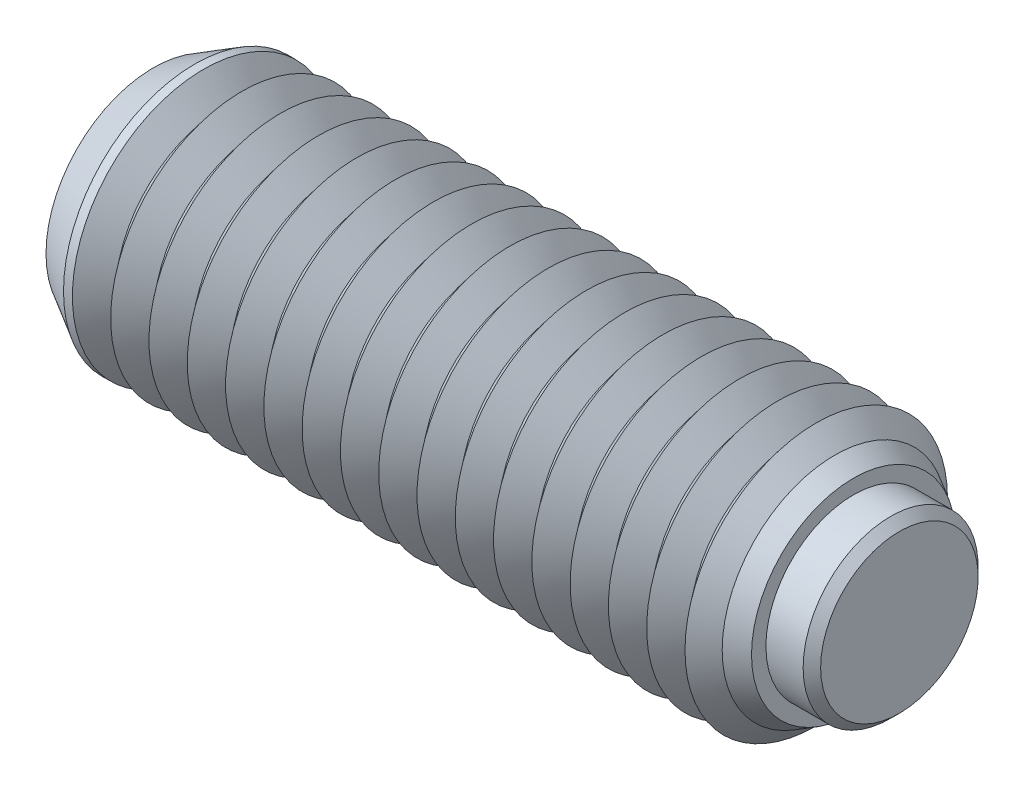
ISO-10303-21;
HEADER;
FILE_DESCRIPTION(('STEP AP214'),'2;1');
FILE_NAME('part.step','',(''),(''),'','','');
FILE_SCHEMA(('AUTOMOTIVE_DESIGN { 1 0 10303 214 1 1 1 1 }'));
ENDSEC;
DATA;
#1=APPLICATION_CONTEXT('core data for automotive mechanical design processes');
#2=APPLICATION_PROTOCOL_DEFINITION('international standard','automotive_design',2000,#1);
#3=PRODUCT_CONTEXT('',#1,'mechanical');
#4=PRODUCT('Part','Part','',(#3));
#5=PRODUCT_RELATED_PRODUCT_CATEGORY('part','',(#4));
#6=PRODUCT_DEFINITION_FORMATION('','',#4);
#7=PRODUCT_DEFINITION_CONTEXT('part definition',#1,'design');
#8=PRODUCT_DEFINITION('design','',#6,#7);
#9=PRODUCT_DEFINITION_SHAPE('','',#8);
#10=(LENGTH_UNIT() NAMED_UNIT(*) SI_UNIT(.MILLI.,.METRE.));
#11=(NAMED_UNIT(*) PLANE_ANGLE_UNIT() SI_UNIT($,.RADIAN.));
#12=(NAMED_UNIT(*) SI_UNIT($,.STERADIAN.) SOLID_ANGLE_UNIT());
#13=UNCERTAINTY_MEASURE_WITH_UNIT(LENGTH_MEASURE(1.E-05),#10,'distance_accuracy_value','');
#14=(GEOMETRIC_REPRESENTATION_CONTEXT(3) GLOBAL_UNCERTAINTY_ASSIGNED_CONTEXT((#13)) GLOBAL_UNIT_ASSIGNED_CONTEXT((#10,
#11,#12)) REPRESENTATION_CONTEXT('',''));
#15=CARTESIAN_POINT('',(0.,0.,0.));
#16=DIRECTION('',(0.,0.,1.));
#17=DIRECTION('',(1.,0.,0.));
#18=AXIS2_PLACEMENT_3D('',#15,#16,#17);
#19=CARTESIAN_POINT('',(2.95,0.,0.));
#20=DIRECTION('',(-1.,0.,0.));
#21=DIRECTION('',(0.,0.,1.));
#22=AXIS2_PLACEMENT_3D('',#19,#20,#21);
#23=CYLINDRICAL_SURFACE('',#22,4.);
#24=CARTESIAN_POINT('',(2.55,0.,0.));
#25=DIRECTION('',(1.,0.,0.));
#26=DIRECTION('',(0.,0.,-1.));
#27=AXIS2_PLACEMENT_3D('',#24,#25,#26);
#28=CIRCLE('',#27,4.);
#29=CARTESIAN_POINT('',(2.55,0.,4.));
#30=VERTEX_POINT('',#29);
#31=EDGE_CURVE('P0_E10',#30,#30,#28,.F.);
#32=ORIENTED_EDGE('',*,*,#31,.T.);
#33=EDGE_LOOP('',(#32));
#34=FACE_BOUND('',#33,.T.);
#35=CARTESIAN_POINT('',(-1.25,0.,0.));
#36=DIRECTION('',(1.,0.,0.));
#37=DIRECTION('',(0.,0.,-1.));
#38=AXIS2_PLACEMENT_3D('',#35,#36,#37);
#39=CIRCLE('',#38,4.);
#40=CARTESIAN_POINT('',(-1.25,0.,-4.));
#41=VERTEX_POINT('',#40);
#42=EDGE_CURVE('P0_E25',#41,#41,#39,.T.);
#43=ORIENTED_EDGE('',*,*,#42,.T.);
#44=EDGE_LOOP('',(#43));
#45=FACE_BOUND('',#44,.T.);
#46=ADVANCED_FACE('P0_F14',(#34,#45),#23,.T.);
#47=CARTESIAN_POINT('',(2.95,0.,0.));
#48=DIRECTION('',(1.,0.,0.));
#49=DIRECTION('',(0.,0.,-1.));
#50=AXIS2_PLACEMENT_3D('',#47,#48,#49);
#51=PLANE('',#50);
#52=CARTESIAN_POINT('',(2.95,0.,0.));
#53=DIRECTION('',(1.,0.,0.));
#54=DIRECTION('',(0.,0.,-1.));
#55=AXIS2_PLACEMENT_3D('',#52,#53,#54);
#56=CIRCLE('',#55,3.6);
#57=CARTESIAN_POINT('',(2.95,0.,3.6));
#58=VERTEX_POINT('',#57);
#59=EDGE_CURVE('P0_E21',#58,#58,#56,.T.);
#60=ORIENTED_EDGE('',*,*,#59,.T.);
#61=EDGE_LOOP('',(#60));
#62=FACE_BOUND('',#61,.T.);
#63=ADVANCED_FACE('P0_F35',(#62),#51,.T.);
#64=CARTESIAN_POINT('',(-1.25,0.,0.));
#65=DIRECTION('',(1.,0.,0.));
#66=DIRECTION('',(0.,0.,-1.));
#67=AXIS2_PLACEMENT_3D('',#64,#65,#66);
#68=PLANE('',#67);
#69=ORIENTED_EDGE('',*,*,#42,.F.);
#70=EDGE_LOOP('',(#69));
#71=FACE_BOUND('',#70,.T.);
#72=ADVANCED_FACE('P0_F33',(#71),#68,.F.);
#73=CARTESIAN_POINT('',(2.95,0.,0.));
#74=DIRECTION('',(-1.,0.,0.));
#75=DIRECTION('',(0.,0.,1.));
#76=AXIS2_PLACEMENT_3D('',#73,#74,#75);
#77=CONICAL_SURFACE('',#76,3.6,0.785398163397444);
#78=CARTESIAN_POINT('',(2.55,0.,4.));
#79=CARTESIAN_POINT('',(2.55416666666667,0.,3.99583333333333));
#80=CARTESIAN_POINT('',(2.55833333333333,0.,3.99166666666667));
#81=CARTESIAN_POINT('',(2.56666666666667,0.,3.98333333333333));
#82=CARTESIAN_POINT('',(2.57083333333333,0.,3.97916666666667));
#83=CARTESIAN_POINT('',(2.57916666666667,0.,3.97083333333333));
#84=CARTESIAN_POINT('',(2.58333333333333,0.,3.96666666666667));
#85=CARTESIAN_POINT('',(2.59166666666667,0.,3.95833333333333));
#86=CARTESIAN_POINT('',(2.59583333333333,0.,3.95416666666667));
#87=CARTESIAN_POINT('',(2.60416666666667,0.,3.94583333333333));
#88=CARTESIAN_POINT('',(2.60833333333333,0.,3.94166666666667));
#89=CARTESIAN_POINT('',(2.61666666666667,0.,3.93333333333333));
#90=CARTESIAN_POINT('',(2.62083333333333,0.,3.92916666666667));
#91=CARTESIAN_POINT('',(2.62916666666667,0.,3.92083333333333));
#92=CARTESIAN_POINT('',(2.63333333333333,0.,3.91666666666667));
#93=CARTESIAN_POINT('',(2.64166666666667,0.,3.90833333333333));
#94=CARTESIAN_POINT('',(2.64583333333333,0.,3.90416666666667));
#95=CARTESIAN_POINT('',(2.65416666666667,0.,3.89583333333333));
#96=CARTESIAN_POINT('',(2.65833333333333,0.,3.89166666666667));
#97=CARTESIAN_POINT('',(2.66666666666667,0.,3.88333333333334));
#98=CARTESIAN_POINT('',(2.67083333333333,0.,3.87916666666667));
#99=CARTESIAN_POINT('',(2.67916666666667,0.,3.87083333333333));
#100=CARTESIAN_POINT('',(2.68333333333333,0.,3.86666666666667));
#101=CARTESIAN_POINT('',(2.69166666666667,0.,3.85833333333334));
#102=CARTESIAN_POINT('',(2.69583333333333,0.,3.85416666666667));
#103=CARTESIAN_POINT('',(2.70416666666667,0.,3.84583333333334));
#104=CARTESIAN_POINT('',(2.70833333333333,0.,3.84166666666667));
#105=CARTESIAN_POINT('',(2.71666666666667,0.,3.83333333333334));
#106=CARTESIAN_POINT('',(2.72083333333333,0.,3.82916666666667));
#107=CARTESIAN_POINT('',(2.72916666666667,0.,3.82083333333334));
#108=CARTESIAN_POINT('',(2.73333333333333,0.,3.81666666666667));
#109=CARTESIAN_POINT('',(2.74166666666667,0.,3.80833333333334));
#110=CARTESIAN_POINT('',(2.74583333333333,0.,3.80416666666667));
#111=CARTESIAN_POINT('',(2.75416666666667,0.,3.79583333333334));
#112=CARTESIAN_POINT('',(2.75833333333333,0.,3.79166666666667));
#113=CARTESIAN_POINT('',(2.76666666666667,0.,3.78333333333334));
#114=CARTESIAN_POINT('',(2.77083333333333,0.,3.77916666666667));
#115=CARTESIAN_POINT('',(2.77916666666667,0.,3.77083333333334));
#116=CARTESIAN_POINT('',(2.78333333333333,0.,3.76666666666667));
#117=CARTESIAN_POINT('',(2.79166666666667,0.,3.75833333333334));
#118=CARTESIAN_POINT('',(2.79583333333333,0.,3.75416666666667));
#119=CARTESIAN_POINT('',(2.80416666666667,0.,3.74583333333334));
#120=CARTESIAN_POINT('',(2.80833333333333,0.,3.74166666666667));
#121=CARTESIAN_POINT('',(2.81666666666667,0.,3.73333333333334));
#122=CARTESIAN_POINT('',(2.82083333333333,0.,3.72916666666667));
#123=CARTESIAN_POINT('',(2.82916666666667,0.,3.72083333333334));
#124=CARTESIAN_POINT('',(2.83333333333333,0.,3.71666666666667));
#125=CARTESIAN_POINT('',(2.84166666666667,0.,3.70833333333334));
#126=CARTESIAN_POINT('',(2.84583333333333,0.,3.70416666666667));
#127=CARTESIAN_POINT('',(2.85416666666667,0.,3.69583333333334));
#128=CARTESIAN_POINT('',(2.85833333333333,0.,3.69166666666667));
#129=CARTESIAN_POINT('',(2.86666666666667,0.,3.68333333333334));
#130=CARTESIAN_POINT('',(2.87083333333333,0.,3.67916666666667));
#131=CARTESIAN_POINT('',(2.87916666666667,0.,3.67083333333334));
#132=CARTESIAN_POINT('',(2.88333333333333,0.,3.66666666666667));
#133=CARTESIAN_POINT('',(2.89166666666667,0.,3.65833333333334));
#134=CARTESIAN_POINT('',(2.89583333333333,0.,3.65416666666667));
#135=CARTESIAN_POINT('',(2.90416666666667,0.,3.64583333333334));
#136=CARTESIAN_POINT('',(2.90833333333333,0.,3.64166666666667));
#137=CARTESIAN_POINT('',(2.91666666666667,0.,3.63333333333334));
#138=CARTESIAN_POINT('',(2.92083333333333,0.,3.62916666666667));
#139=CARTESIAN_POINT('',(2.92916666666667,0.,3.62083333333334));
#140=CARTESIAN_POINT('',(2.93333333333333,0.,3.61666666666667));
#141=CARTESIAN_POINT('',(2.94166666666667,0.,3.60833333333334));
#142=CARTESIAN_POINT('',(2.94583333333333,0.,3.60416666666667));
#143=CARTESIAN_POINT('',(2.95,0.,3.6));
#144=B_SPLINE_CURVE_WITH_KNOTS('',3,(#78,#79,#80,#81,#82,#83,#84,#85,#86,#87,#88,#89,#90,#91,
#92,#93,#94,#95,#96,#97,#98,#99,#100,#101,#102,#103,#104,#105,#106,#107,#108,#109,#110,#111,
#112,#113,#114,#115,#116,#117,#118,#119,#120,#121,#122,#123,#124,#125,#126,#127,#128,#129,#130,
#131,#132,#133,#134,#135,#136,#137,#138,#139,#140,#141,#142,#143),.UNSPECIFIED.,.F.,.F.,(4,2,2,
2,2,2,2,2,2,2,2,2,2,2,2,2,2,2,2,2,2,2,2,2,2,2,2,2,2,2,2,2,4),(0.,0.0176776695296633,
0.0353553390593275,0.0530330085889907,0.070710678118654,0.0883883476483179,0.106066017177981,
0.123743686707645,0.141421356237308,0.159099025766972,0.176776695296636,0.194454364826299,
0.212132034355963,0.229809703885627,0.24748737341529,0.265165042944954,0.282842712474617,
0.300520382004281,0.318198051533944,0.335875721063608,0.353553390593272,0.371231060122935,
0.388908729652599,0.406586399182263,0.424264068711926,0.44194173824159,0.459619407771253,
0.477297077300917,0.49497474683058,0.512652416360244,0.530330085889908,0.548007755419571,
0.565685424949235),.UNSPECIFIED.);
#145=EDGE_CURVE('P0_BSEAM16',#30,#58,#144,.T.);
#146=ORIENTED_EDGE('',*,*,#31,.F.);
#147=ORIENTED_EDGE('',*,*,#59,.F.);
#148=ORIENTED_EDGE('',*,*,#145,.T.);
#149=ORIENTED_EDGE('',*,*,#145,.F.);
#150=EDGE_LOOP('',(#146,#148,#147,#149));
#151=FACE_BOUND('',#150,.T.);
#152=ADVANCED_FACE('P0_F16',(#151),#77,.T.);
#153=CLOSED_SHELL('',(#46,#63,#72,#152));
#154=MANIFOLD_SOLID_BREP('P0_B1',#153);
#155=CARTESIAN_POINT('',(-31.15,0.,0.));
#156=DIRECTION('',(1.,0.,0.));
#157=DIRECTION('',(0.,0.,-1.));
#158=AXIS2_PLACEMENT_3D('',#155,#156,#157);
#159=CYLINDRICAL_SURFACE('',#158,6.);
#160=CARTESIAN_POINT('',(-28.85,0.,0.));
#161=DIRECTION('',(1.,0.,0.));
#162=DIRECTION('',(0.,0.,-1.));
#163=AXIS2_PLACEMENT_3D('',#160,#161,#162);
#164=CIRCLE('',#163,6.);
#165=CARTESIAN_POINT('',(-28.85,0.,-6.));
#166=VERTEX_POINT('',#165);
#167=EDGE_CURVE('P1_E226',#166,#166,#164,.T.);
#168=ORIENTED_EDGE('',*,*,#167,.F.);
#169=EDGE_LOOP('',(#168));
#170=FACE_BOUND('',#169,.T.);
#171=CARTESIAN_POINT('',(-29.2570855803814,0.,0.));
#172=DIRECTION('',(1.,0.,0.));
#173=DIRECTION('',(0.,0.,-1.));
#174=AXIS2_PLACEMENT_3D('',#171,#172,#173);
#175=CIRCLE('',#174,6.);
#176=CARTESIAN_POINT('',(-29.2570855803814,0.,-6.));
#177=VERTEX_POINT('',#176);
#178=EDGE_CURVE('P1_E229',#177,#177,#175,.T.);
#179=ORIENTED_EDGE('',*,*,#178,.T.);
#180=EDGE_LOOP('',(#179));
#181=FACE_BOUND('',#180,.T.);
#182=ADVANCED_FACE('P1_F15',(#170,#181),#159,.T.);
#183=CARTESIAN_POINT('',(-1.725,0.,0.));
#184=DIRECTION('',(1.,0.,0.));
#185=DIRECTION('',(0.,0.,-1.));
#186=AXIS2_PLACEMENT_3D('',#183,#184,#185);
#187=CONICAL_SURFACE('',#186,4.90712535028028,0.895664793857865);
#188=CARTESIAN_POINT('',(-0.850000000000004,0.,0.));
#189=DIRECTION('',(1.,0.,0.));
#190=DIRECTION('',(0.,0.,-1.));
#191=AXIS2_PLACEMENT_3D('',#188,#189,#190);
#192=CIRCLE('',#191,6.);
#193=CARTESIAN_POINT('',(-0.850000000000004,0.,6.));
#194=VERTEX_POINT('',#193);
#195=EDGE_CURVE('P1_E284',#194,#194,#192,.T.);
#196=ORIENTED_EDGE('',*,*,#195,.F.);
#197=EDGE_LOOP('',(#196));
#198=FACE_BOUND('',#197,.T.);
#199=CARTESIAN_POINT('',(-1.725,0.,0.));
#200=DIRECTION('',(1.,0.,0.));
#201=DIRECTION('',(0.,0.,-1.));
#202=AXIS2_PLACEMENT_3D('',#199,#200,#201);
#203=CIRCLE('',#202,4.90712535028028);
#204=CARTESIAN_POINT('',(-1.725,0.,-4.90712535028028));
#205=VERTEX_POINT('',#204);
#206=EDGE_CURVE('P1_E289',#205,#205,#203,.T.);
#207=ORIENTED_EDGE('',*,*,#206,.T.);
#208=EDGE_LOOP('',(#207));
#209=FACE_BOUND('',#208,.T.);
#210=ADVANCED_FACE('P1_F214',(#198,#209),#187,.T.);
#211=CARTESIAN_POINT('',(-2.6,0.,0.));
#212=DIRECTION('',(-1.,0.,0.));
#213=DIRECTION('',(0.,0.,1.));
#214=AXIS2_PLACEMENT_3D('',#211,#212,#213);
#215=CONICAL_SURFACE('',#214,6.,0.895664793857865);
#216=ORIENTED_EDGE('',*,*,#206,.F.);
#217=EDGE_LOOP('',(#216));
#218=FACE_BOUND('',#217,.T.);
#219=CARTESIAN_POINT('',(-2.6,0.,0.));
#220=DIRECTION('',(1.,0.,0.));
#221=DIRECTION('',(0.,0.,-1.));
#222=AXIS2_PLACEMENT_3D('',#219,#220,#221);
#223=CIRCLE('',#222,6.);
#224=CARTESIAN_POINT('',(-2.6,0.,-6.));
#225=VERTEX_POINT('',#224);
#226=EDGE_CURVE('P1_E292',#225,#225,#223,.T.);
#227=ORIENTED_EDGE('',*,*,#226,.T.);
#228=EDGE_LOOP('',(#227));
#229=FACE_BOUND('',#228,.T.);
#230=ADVANCED_FACE('P1_F220',(#218,#229),#215,.T.);
#231=CARTESIAN_POINT('',(-1.25,0.,0.));
#232=DIRECTION('',(1.,0.,0.));
#233=DIRECTION('',(0.,1.,0.));
#234=AXIS2_PLACEMENT_3D('',#231,#232,#233);
#235=PLANE('',#234);
#236=CARTESIAN_POINT('',(-1.25,0.,0.));
#237=DIRECTION('',(1.,0.,0.));
#238=DIRECTION('',(0.,1.,0.));
#239=AXIS2_PLACEMENT_3D('',#236,#237,#238);
#240=CIRCLE('',#239,4.);
#241=CARTESIAN_POINT('',(-1.25,4.,0.));
#242=VERTEX_POINT('',#241);
#243=EDGE_CURVE('P1_E279',#242,#242,#240,.T.);
#244=ORIENTED_EDGE('',*,*,#243,.T.);
#245=EDGE_LOOP('',(#244));
#246=FACE_BOUND('',#245,.T.);
#247=ADVANCED_FACE('P1_F507',(#246),#235,.T.);
#248=CARTESIAN_POINT('',(-1.25,0.,0.));
#249=DIRECTION('',(1.,0.,0.));
#250=DIRECTION('',(0.,1.,0.));
#251=AXIS2_PLACEMENT_3D('',#248,#249,#250);
#252=CYLINDRICAL_SURFACE('',#251,4.);
#253=ORIENTED_EDGE('',*,*,#243,.F.);
#254=EDGE_LOOP('',(#253));
#255=FACE_BOUND('',#254,.T.);
#256=CARTESIAN_POINT('',(0.85,0.,0.));
#257=DIRECTION('',(1.,0.,0.));
#258=DIRECTION('',(0.,1.,0.));
#259=AXIS2_PLACEMENT_3D('',#256,#257,#258);
#260=CIRCLE('',#259,4.);
#261=CARTESIAN_POINT('',(0.85,4.,0.));
#262=VERTEX_POINT('',#261);
#263=EDGE_CURVE('P1_E281',#262,#262,#260,.T.);
#264=ORIENTED_EDGE('',*,*,#263,.T.);
#265=EDGE_LOOP('',(#264));
#266=FACE_BOUND('',#265,.T.);
#267=ADVANCED_FACE('P1_F210',(#255,#266),#252,.F.);
#268=CARTESIAN_POINT('',(0.849999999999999,4.65925227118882,0.));
#269=DIRECTION('',(1.,0.,0.));
#270=DIRECTION('',(0.,1.,0.));
#271=AXIS2_PLACEMENT_3D('',#268,#269,#270);
#272=PLANE('',#271);
#273=ORIENTED_EDGE('',*,*,#263,.F.);
#274=EDGE_LOOP('',(#273));
#275=FACE_BOUND('',#274,.T.);
#276=CARTESIAN_POINT('',(0.85,0.,0.));
#277=DIRECTION('',(1.,0.,0.));
#278=DIRECTION('',(0.,1.,0.));
#279=AXIS2_PLACEMENT_3D('',#276,#277,#278);
#280=CIRCLE('',#279,4.65925227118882);
#281=CARTESIAN_POINT('',(0.849999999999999,4.65925227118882,0.));
#282=VERTEX_POINT('',#281);
#283=EDGE_CURVE('P1_E121',#282,#282,#280,.T.);
#284=ORIENTED_EDGE('',*,*,#283,.T.);
#285=EDGE_LOOP('',(#284));
#286=FACE_BOUND('',#285,.T.);
#287=ADVANCED_FACE('P1_F206',(#275,#286),#272,.T.);
#288=CARTESIAN_POINT('',(0.85,0.,0.));
#289=DIRECTION('',(-1.,0.,0.));
#290=DIRECTION('',(0.,-1.,0.));
#291=AXIS2_PLACEMENT_3D('',#288,#289,#290);
#292=CONICAL_SURFACE('',#291,4.65925227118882,0.523598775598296);
#293=CARTESIAN_POINT('',(0.,0.,0.));
#294=DIRECTION('',(1.,0.,0.));
#295=DIRECTION('',(0.,0.,-1.));
#296=AXIS2_PLACEMENT_3D('',#293,#294,#295);
#297=CIRCLE('',#296,5.15);
#298=CARTESIAN_POINT('',(0.,0.,5.15));
#299=VERTEX_POINT('',#298);
#300=EDGE_CURVE('P1_E236',#299,#299,#297,.T.);
#301=ORIENTED_EDGE('',*,*,#300,.T.);
#302=EDGE_LOOP('',(#301));
#303=FACE_BOUND('',#302,.T.);
#304=ORIENTED_EDGE('',*,*,#283,.F.);
#305=EDGE_LOOP('',(#304));
#306=FACE_BOUND('',#305,.T.);
#307=ADVANCED_FACE('P1_F203',(#303,#306),#292,.T.);
#308=CARTESIAN_POINT('',(0.,0.,0.));
#309=DIRECTION('',(-1.,0.,0.));
#310=DIRECTION('',(0.,0.,1.));
#311=AXIS2_PLACEMENT_3D('',#308,#309,#310);
#312=CONICAL_SURFACE('',#311,5.15,0.785398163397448);
#313=CARTESIAN_POINT('',(-0.850000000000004,0.,6.));
#314=CARTESIAN_POINT('',(-0.841145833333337,0.,5.99114583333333));
#315=CARTESIAN_POINT('',(-0.83229166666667,0.,5.98229166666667));
#316=CARTESIAN_POINT('',(-0.814583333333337,0.,5.96458333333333));
#317=CARTESIAN_POINT('',(-0.80572916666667,0.,5.95572916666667));
#318=CARTESIAN_POINT('',(-0.788020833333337,0.,5.93802083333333));
#319=CARTESIAN_POINT('',(-0.77916666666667,0.,5.92916666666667));
#320=CARTESIAN_POINT('',(-0.761458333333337,0.,5.91145833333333));
#321=CARTESIAN_POINT('',(-0.75260416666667,0.,5.90260416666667));
#322=CARTESIAN_POINT('',(-0.734895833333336,0.,5.88489583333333));
#323=CARTESIAN_POINT('',(-0.72604166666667,0.,5.87604166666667));
#324=CARTESIAN_POINT('',(-0.708333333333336,0.,5.85833333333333));
#325=CARTESIAN_POINT('',(-0.69947916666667,0.,5.84947916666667));
#326=CARTESIAN_POINT('',(-0.681770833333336,0.,5.83177083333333));
#327=CARTESIAN_POINT('',(-0.67291666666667,0.,5.82291666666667));
#328=CARTESIAN_POINT('',(-0.655208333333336,0.,5.80520833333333));
#329=CARTESIAN_POINT('',(-0.646354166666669,0.,5.79635416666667));
#330=CARTESIAN_POINT('',(-0.628645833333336,0.,5.77864583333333));
#331=CARTESIAN_POINT('',(-0.619791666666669,0.,5.76979166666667));
#332=CARTESIAN_POINT('',(-0.602083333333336,0.,5.75208333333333));
#333=CARTESIAN_POINT('',(-0.593229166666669,0.,5.74322916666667));
#334=CARTESIAN_POINT('',(-0.575520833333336,0.,5.72552083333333));
#335=CARTESIAN_POINT('',(-0.566666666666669,0.,5.71666666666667));
#336=CARTESIAN_POINT('',(-0.548958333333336,0.,5.69895833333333));
#337=CARTESIAN_POINT('',(-0.540104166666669,0.,5.69010416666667));
#338=CARTESIAN_POINT('',(-0.522395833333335,0.,5.67239583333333));
#339=CARTESIAN_POINT('',(-0.513541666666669,0.,5.66354166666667));
#340=CARTESIAN_POINT('',(-0.495833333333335,0.,5.64583333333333));
#341=CARTESIAN_POINT('',(-0.486979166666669,0.,5.63697916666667));
#342=CARTESIAN_POINT('',(-0.469270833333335,0.,5.61927083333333));
#343=CARTESIAN_POINT('',(-0.460416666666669,0.,5.61041666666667));
#344=CARTESIAN_POINT('',(-0.442708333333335,0.,5.59270833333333));
#345=CARTESIAN_POINT('',(-0.433854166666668,0.,5.58385416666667));
#346=CARTESIAN_POINT('',(-0.416145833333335,0.,5.56614583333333));
#347=CARTESIAN_POINT('',(-0.407291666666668,0.,5.55729166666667));
#348=CARTESIAN_POINT('',(-0.389583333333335,0.,5.53958333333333));
#349=CARTESIAN_POINT('',(-0.380729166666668,0.,5.53072916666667));
#350=CARTESIAN_POINT('',(-0.363020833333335,0.,5.51302083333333));
#351=CARTESIAN_POINT('',(-0.354166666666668,0.,5.50416666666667));
#352=CARTESIAN_POINT('',(-0.336458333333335,0.,5.48645833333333));
#353=CARTESIAN_POINT('',(-0.327604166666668,0.,5.47760416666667));
#354=CARTESIAN_POINT('',(-0.309895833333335,0.,5.45989583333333));
#355=CARTESIAN_POINT('',(-0.301041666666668,0.,5.45104166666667));
#356=CARTESIAN_POINT('',(-0.283333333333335,0.,5.43333333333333));
#357=CARTESIAN_POINT('',(-0.274479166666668,0.,5.42447916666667));
#358=CARTESIAN_POINT('',(-0.256770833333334,0.,5.40677083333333));
#359=CARTESIAN_POINT('',(-0.247916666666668,0.,5.39791666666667));
#360=CARTESIAN_POINT('',(-0.230208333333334,0.,5.38020833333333));
#361=CARTESIAN_POINT('',(-0.221354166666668,0.,5.37135416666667));
#362=CARTESIAN_POINT('',(-0.203645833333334,0.,5.35364583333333));
#363=CARTESIAN_POINT('',(-0.194791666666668,0.,5.34479166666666));
#364=CARTESIAN_POINT('',(-0.177083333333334,0.,5.32708333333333));
#365=CARTESIAN_POINT('',(-0.168229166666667,0.,5.31822916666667));
#366=CARTESIAN_POINT('',(-0.150520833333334,0.,5.30052083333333));
#367=CARTESIAN_POINT('',(-0.141666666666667,0.,5.29166666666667));
#368=CARTESIAN_POINT('',(-0.123958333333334,0.,5.27395833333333));
#369=CARTESIAN_POINT('',(-0.115104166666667,0.,5.26510416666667));
#370=CARTESIAN_POINT('',(-0.0973958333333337,0.,5.24739583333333));
#371=CARTESIAN_POINT('',(-0.0885416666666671,0.,5.23854166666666));
#372=CARTESIAN_POINT('',(-0.0708333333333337,0.,5.22083333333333));
#373=CARTESIAN_POINT('',(-0.0619791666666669,0.,5.21197916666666));
#374=CARTESIAN_POINT('',(-0.0442708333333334,0.,5.19427083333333));
#375=CARTESIAN_POINT('',(-0.0354166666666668,0.,5.18541666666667));
#376=CARTESIAN_POINT('',(-0.0177083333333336,0.,5.16770833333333));
#377=CARTESIAN_POINT('',(-0.00885416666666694,0.,5.15885416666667));
#378=CARTESIAN_POINT('',(0.,0.,5.15));
#379=B_SPLINE_CURVE_WITH_KNOTS('',3,(#313,#314,#315,#316,#317,#318,#319,#320,#321,#322,#323,
#324,#325,#326,#327,#328,#329,#330,#331,#332,#333,#334,#335,#336,#337,#338,#339,#340,#341,#342,
#343,#344,#345,#346,#347,#348,#349,#350,#351,#352,#353,#354,#355,#356,#357,#358,#359,#360,#361,
#362,#363,#364,#365,#366,#367,#368,#369,#370,#371,#372,#373,#374,#375,#376,#377,#378),
.UNSPECIFIED.,.F.,.F.,(4,2,2,2,2,2,2,2,2,2,2,2,2,2,2,2,2,2,2,2,2,2,2,2,2,2,2,2,2,2,2,2,4),(0.,
0.0375650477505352,0.075130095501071,0.112695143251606,0.150260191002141,0.187825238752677,
0.225390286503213,0.262955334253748,0.300520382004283,0.338085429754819,0.375650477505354,
0.41321552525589,0.450780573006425,0.488345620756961,0.525910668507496,0.563475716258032,
0.601040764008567,0.638605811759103,0.676170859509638,0.713735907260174,0.751300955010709,
0.788866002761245,0.82643105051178,0.863996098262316,0.901561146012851,0.939126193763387,
0.976691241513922,1.01425628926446,1.05182133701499,1.08938638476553,1.12695143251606,
1.1645164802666,1.20208152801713),.UNSPECIFIED.);
#380=EDGE_CURVE('P1_BSEAM17',#194,#299,#379,.T.);
#381=ORIENTED_EDGE('',*,*,#195,.T.);
#382=ORIENTED_EDGE('',*,*,#300,.F.);
#383=ORIENTED_EDGE('',*,*,#380,.T.);
#384=ORIENTED_EDGE('',*,*,#380,.F.);
#385=EDGE_LOOP('',(#381,#383,#382,#384));
#386=FACE_BOUND('',#385,.T.);
#387=ADVANCED_FACE('P1_F17',(#386),#312,.T.);
#388=CARTESIAN_POINT('',(-3.475,0.,0.));
#389=DIRECTION('',(1.,0.,0.));
#390=DIRECTION('',(0.,0.,-1.));
#391=AXIS2_PLACEMENT_3D('',#388,#389,#390);
#392=CONICAL_SURFACE('',#391,4.90712535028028,0.895664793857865);
#393=ORIENTED_EDGE('',*,*,#226,.F.);
#394=EDGE_LOOP('',(#393));
#395=FACE_BOUND('',#394,.T.);
#396=CARTESIAN_POINT('',(-3.475,0.,0.));
#397=DIRECTION('',(1.,0.,0.));
#398=DIRECTION('',(0.,0.,-1.));
#399=AXIS2_PLACEMENT_3D('',#396,#397,#398);
#400=CIRCLE('',#399,4.90712535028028);
#401=CARTESIAN_POINT('',(-3.475,0.,-4.90712535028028));
#402=VERTEX_POINT('',#401);
#403=EDGE_CURVE('P1_E295',#402,#402,#400,.T.);
#404=ORIENTED_EDGE('',*,*,#403,.T.);
#405=EDGE_LOOP('',(#404));
#406=FACE_BOUND('',#405,.T.);
#407=ADVANCED_FACE('P1_F501',(#395,#406),#392,.T.);
#408=CARTESIAN_POINT('',(-4.35,0.,0.));
#409=DIRECTION('',(-1.,0.,0.));
#410=DIRECTION('',(0.,0.,1.));
#411=AXIS2_PLACEMENT_3D('',#408,#409,#410);
#412=CONICAL_SURFACE('',#411,6.,0.895664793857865);
#413=ORIENTED_EDGE('',*,*,#403,.F.);
#414=EDGE_LOOP('',(#413));
#415=FACE_BOUND('',#414,.T.);
#416=CARTESIAN_POINT('',(-4.35,0.,0.));
#417=DIRECTION('',(1.,0.,0.));
#418=DIRECTION('',(0.,0.,-1.));
#419=AXIS2_PLACEMENT_3D('',#416,#417,#418);
#420=CIRCLE('',#419,6.);
#421=CARTESIAN_POINT('',(-4.35,0.,-6.));
#422=VERTEX_POINT('',#421);
#423=EDGE_CURVE('P1_E298',#422,#422,#420,.T.);
#424=ORIENTED_EDGE('',*,*,#423,.T.);
#425=EDGE_LOOP('',(#424));
#426=FACE_BOUND('',#425,.T.);
#427=ADVANCED_FACE('P1_F497',(#415,#426),#412,.T.);
#428=CARTESIAN_POINT('',(-5.225,0.,0.));
#429=DIRECTION('',(1.,0.,0.));
#430=DIRECTION('',(0.,0.,-1.));
#431=AXIS2_PLACEMENT_3D('',#428,#429,#430);
#432=CONICAL_SURFACE('',#431,4.90712535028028,0.895664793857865);
#433=ORIENTED_EDGE('',*,*,#423,.F.);
#434=EDGE_LOOP('',(#433));
#435=FACE_BOUND('',#434,.T.);
#436=CARTESIAN_POINT('',(-5.225,0.,0.));
#437=DIRECTION('',(1.,0.,0.));
#438=DIRECTION('',(0.,0.,-1.));
#439=AXIS2_PLACEMENT_3D('',#436,#437,#438);
#440=CIRCLE('',#439,4.90712535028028);
#441=CARTESIAN_POINT('',(-5.225,0.,-4.90712535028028));
#442=VERTEX_POINT('',#441);
#443=EDGE_CURVE('P1_E301',#442,#442,#440,.T.);
#444=ORIENTED_EDGE('',*,*,#443,.T.);
#445=EDGE_LOOP('',(#444));
#446=FACE_BOUND('',#445,.T.);
#447=ADVANCED_FACE('P1_F493',(#435,#446),#432,.T.);
#448=CARTESIAN_POINT('',(-6.1,0.,0.));
#449=DIRECTION('',(-1.,0.,0.));
#450=DIRECTION('',(0.,0.,1.));
#451=AXIS2_PLACEMENT_3D('',#448,#449,#450);
#452=CONICAL_SURFACE('',#451,6.,0.895664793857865);
#453=ORIENTED_EDGE('',*,*,#443,.F.);
#454=EDGE_LOOP('',(#453));
#455=FACE_BOUND('',#454,.T.);
#456=CARTESIAN_POINT('',(-6.1,0.,0.));
#457=DIRECTION('',(1.,0.,0.));
#458=DIRECTION('',(0.,0.,-1.));
#459=AXIS2_PLACEMENT_3D('',#456,#457,#458);
#460=CIRCLE('',#459,6.);
#461=CARTESIAN_POINT('',(-6.1,0.,-6.));
#462=VERTEX_POINT('',#461);
#463=EDGE_CURVE('P1_E304',#462,#462,#460,.T.);
#464=ORIENTED_EDGE('',*,*,#463,.T.);
#465=EDGE_LOOP('',(#464));
#466=FACE_BOUND('',#465,.T.);
#467=ADVANCED_FACE('P1_F489',(#455,#466),#452,.T.);
#468=CARTESIAN_POINT('',(-6.975,0.,0.));
#469=DIRECTION('',(1.,0.,0.));
#470=DIRECTION('',(0.,0.,-1.));
#471=AXIS2_PLACEMENT_3D('',#468,#469,#470);
#472=CONICAL_SURFACE('',#471,4.90712535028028,0.895664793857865);
#473=ORIENTED_EDGE('',*,*,#463,.F.);
#474=EDGE_LOOP('',(#473));
#475=FACE_BOUND('',#474,.T.);
#476=CARTESIAN_POINT('',(-6.975,0.,0.));
#477=DIRECTION('',(1.,0.,0.));
#478=DIRECTION('',(0.,0.,-1.));
#479=AXIS2_PLACEMENT_3D('',#476,#477,#478);
#480=CIRCLE('',#479,4.90712535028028);
#481=CARTESIAN_POINT('',(-6.975,0.,-4.90712535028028));
#482=VERTEX_POINT('',#481);
#483=EDGE_CURVE('P1_E307',#482,#482,#480,.T.);
#484=ORIENTED_EDGE('',*,*,#483,.T.);
#485=EDGE_LOOP('',(#484));
#486=FACE_BOUND('',#485,.T.);
#487=ADVANCED_FACE('P1_F485',(#475,#486),#472,.T.);
#488=CARTESIAN_POINT('',(-7.85,0.,0.));
#489=DIRECTION('',(-1.,0.,0.));
#490=DIRECTION('',(0.,0.,1.));
#491=AXIS2_PLACEMENT_3D('',#488,#489,#490);
#492=CONICAL_SURFACE('',#491,6.,0.895664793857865);
#493=ORIENTED_EDGE('',*,*,#483,.F.);
#494=EDGE_LOOP('',(#493));
#495=FACE_BOUND('',#494,.T.);
#496=CARTESIAN_POINT('',(-7.85,0.,0.));
#497=DIRECTION('',(1.,0.,0.));
#498=DIRECTION('',(0.,0.,-1.));
#499=AXIS2_PLACEMENT_3D('',#496,#497,#498);
#500=CIRCLE('',#499,6.);
#501=CARTESIAN_POINT('',(-7.85,0.,-6.));
#502=VERTEX_POINT('',#501);
#503=EDGE_CURVE('P1_E310',#502,#502,#500,.T.);
#504=ORIENTED_EDGE('',*,*,#503,.T.);
#505=EDGE_LOOP('',(#504));
#506=FACE_BOUND('',#505,.T.);
#507=ADVANCED_FACE('P1_F481',(#495,#506),#492,.T.);
#508=CARTESIAN_POINT('',(-8.725,0.,0.));
#509=DIRECTION('',(1.,0.,0.));
#510=DIRECTION('',(0.,0.,-1.));
#511=AXIS2_PLACEMENT_3D('',#508,#509,#510);
#512=CONICAL_SURFACE('',#511,4.90712535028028,0.895664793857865);
#513=ORIENTED_EDGE('',*,*,#503,.F.);
#514=EDGE_LOOP('',(#513));
#515=FACE_BOUND('',#514,.T.);
#516=CARTESIAN_POINT('',(-8.725,0.,0.));
#517=DIRECTION('',(1.,0.,0.));
#518=DIRECTION('',(0.,0.,-1.));
#519=AXIS2_PLACEMENT_3D('',#516,#517,#518);
#520=CIRCLE('',#519,4.90712535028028);
#521=CARTESIAN_POINT('',(-8.725,0.,-4.90712535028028));
#522=VERTEX_POINT('',#521);
#523=EDGE_CURVE('P1_E313',#522,#522,#520,.T.);
#524=ORIENTED_EDGE('',*,*,#523,.T.);
#525=EDGE_LOOP('',(#524));
#526=FACE_BOUND('',#525,.T.);
#527=ADVANCED_FACE('P1_F477',(#515,#526),#512,.T.);
#528=CARTESIAN_POINT('',(-9.6,0.,0.));
#529=DIRECTION('',(-1.,0.,0.));
#530=DIRECTION('',(0.,0.,1.));
#531=AXIS2_PLACEMENT_3D('',#528,#529,#530);
#532=CONICAL_SURFACE('',#531,6.,0.895664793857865);
#533=ORIENTED_EDGE('',*,*,#523,.F.);
#534=EDGE_LOOP('',(#533));
#535=FACE_BOUND('',#534,.T.);
#536=CARTESIAN_POINT('',(-9.6,0.,0.));
#537=DIRECTION('',(1.,0.,0.));
#538=DIRECTION('',(0.,0.,-1.));
#539=AXIS2_PLACEMENT_3D('',#536,#537,#538);
#540=CIRCLE('',#539,6.);
#541=CARTESIAN_POINT('',(-9.6,0.,-6.));
#542=VERTEX_POINT('',#541);
#543=EDGE_CURVE('P1_E316',#542,#542,#540,.T.);
#544=ORIENTED_EDGE('',*,*,#543,.T.);
#545=EDGE_LOOP('',(#544));
#546=FACE_BOUND('',#545,.T.);
#547=ADVANCED_FACE('P1_F473',(#535,#546),#532,.T.);
#548=CARTESIAN_POINT('',(-10.475,0.,0.));
#549=DIRECTION('',(1.,0.,0.));
#550=DIRECTION('',(0.,0.,-1.));
#551=AXIS2_PLACEMENT_3D('',#548,#549,#550);
#552=CONICAL_SURFACE('',#551,4.90712535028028,0.895664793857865);
#553=ORIENTED_EDGE('',*,*,#543,.F.);
#554=EDGE_LOOP('',(#553));
#555=FACE_BOUND('',#554,.T.);
#556=CARTESIAN_POINT('',(-10.475,0.,0.));
#557=DIRECTION('',(1.,0.,0.));
#558=DIRECTION('',(0.,0.,-1.));
#559=AXIS2_PLACEMENT_3D('',#556,#557,#558);
#560=CIRCLE('',#559,4.90712535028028);
#561=CARTESIAN_POINT('',(-10.475,0.,-4.90712535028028));
#562=VERTEX_POINT('',#561);
#563=EDGE_CURVE('P1_E319',#562,#562,#560,.T.);
#564=ORIENTED_EDGE('',*,*,#563,.T.);
#565=EDGE_LOOP('',(#564));
#566=FACE_BOUND('',#565,.T.);
#567=ADVANCED_FACE('P1_F469',(#555,#566),#552,.T.);
#568=CARTESIAN_POINT('',(-11.35,0.,0.));
#569=DIRECTION('',(-1.,0.,0.));
#570=DIRECTION('',(0.,0.,1.));
#571=AXIS2_PLACEMENT_3D('',#568,#569,#570);
#572=CONICAL_SURFACE('',#571,6.,0.895664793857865);
#573=ORIENTED_EDGE('',*,*,#563,.F.);
#574=EDGE_LOOP('',(#573));
#575=FACE_BOUND('',#574,.T.);
#576=CARTESIAN_POINT('',(-11.35,0.,0.));
#577=DIRECTION('',(1.,0.,0.));
#578=DIRECTION('',(0.,0.,-1.));
#579=AXIS2_PLACEMENT_3D('',#576,#577,#578);
#580=CIRCLE('',#579,6.);
#581=CARTESIAN_POINT('',(-11.35,0.,-6.));
#582=VERTEX_POINT('',#581);
#583=EDGE_CURVE('P1_E322',#582,#582,#580,.T.);
#584=ORIENTED_EDGE('',*,*,#583,.T.);
#585=EDGE_LOOP('',(#584));
#586=FACE_BOUND('',#585,.T.);
#587=ADVANCED_FACE('P1_F465',(#575,#586),#572,.T.);
#588=CARTESIAN_POINT('',(-12.225,0.,0.));
#589=DIRECTION('',(1.,0.,0.));
#590=DIRECTION('',(0.,0.,-1.));
#591=AXIS2_PLACEMENT_3D('',#588,#589,#590);
#592=CONICAL_SURFACE('',#591,4.90712535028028,0.895664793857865);
#593=ORIENTED_EDGE('',*,*,#583,.F.);
#594=EDGE_LOOP('',(#593));
#595=FACE_BOUND('',#594,.T.);
#596=CARTESIAN_POINT('',(-12.225,0.,0.));
#597=DIRECTION('',(1.,0.,0.));
#598=DIRECTION('',(0.,0.,-1.));
#599=AXIS2_PLACEMENT_3D('',#596,#597,#598);
#600=CIRCLE('',#599,4.90712535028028);
#601=CARTESIAN_POINT('',(-12.225,0.,-4.90712535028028));
#602=VERTEX_POINT('',#601);
#603=EDGE_CURVE('P1_E325',#602,#602,#600,.T.);
#604=ORIENTED_EDGE('',*,*,#603,.T.);
#605=EDGE_LOOP('',(#604));
#606=FACE_BOUND('',#605,.T.);
#607=ADVANCED_FACE('P1_F461',(#595,#606),#592,.T.);
#608=CARTESIAN_POINT('',(-13.1,0.,0.));
#609=DIRECTION('',(-1.,0.,0.));
#610=DIRECTION('',(0.,0.,1.));
#611=AXIS2_PLACEMENT_3D('',#608,#609,#610);
#612=CONICAL_SURFACE('',#611,6.,0.895664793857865);
#613=ORIENTED_EDGE('',*,*,#603,.F.);
#614=EDGE_LOOP('',(#613));
#615=FACE_BOUND('',#614,.T.);
#616=CARTESIAN_POINT('',(-13.1,0.,0.));
#617=DIRECTION('',(1.,0.,0.));
#618=DIRECTION('',(0.,0.,-1.));
#619=AXIS2_PLACEMENT_3D('',#616,#617,#618);
#620=CIRCLE('',#619,6.);
#621=CARTESIAN_POINT('',(-13.1,0.,-6.));
#622=VERTEX_POINT('',#621);
#623=EDGE_CURVE('P1_E328',#622,#622,#620,.T.);
#624=ORIENTED_EDGE('',*,*,#623,.T.);
#625=EDGE_LOOP('',(#624));
#626=FACE_BOUND('',#625,.T.);
#627=ADVANCED_FACE('P1_F457',(#615,#626),#612,.T.);
#628=CARTESIAN_POINT('',(-13.975,0.,0.));
#629=DIRECTION('',(1.,0.,0.));
#630=DIRECTION('',(0.,0.,-1.));
#631=AXIS2_PLACEMENT_3D('',#628,#629,#630);
#632=CONICAL_SURFACE('',#631,4.90712535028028,0.895664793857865);
#633=ORIENTED_EDGE('',*,*,#623,.F.);
#634=EDGE_LOOP('',(#633));
#635=FACE_BOUND('',#634,.T.);
#636=CARTESIAN_POINT('',(-13.975,0.,0.));
#637=DIRECTION('',(1.,0.,0.));
#638=DIRECTION('',(0.,0.,-1.));
#639=AXIS2_PLACEMENT_3D('',#636,#637,#638);
#640=CIRCLE('',#639,4.90712535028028);
#641=CARTESIAN_POINT('',(-13.975,0.,-4.90712535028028));
#642=VERTEX_POINT('',#641);
#643=EDGE_CURVE('P1_E331',#642,#642,#640,.T.);
#644=ORIENTED_EDGE('',*,*,#643,.T.);
#645=EDGE_LOOP('',(#644));
#646=FACE_BOUND('',#645,.T.);
#647=ADVANCED_FACE('P1_F453',(#635,#646),#632,.T.);
#648=CARTESIAN_POINT('',(-14.85,0.,0.));
#649=DIRECTION('',(-1.,0.,0.));
#650=DIRECTION('',(0.,0.,1.));
#651=AXIS2_PLACEMENT_3D('',#648,#649,#650);
#652=CONICAL_SURFACE('',#651,6.,0.895664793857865);
#653=ORIENTED_EDGE('',*,*,#643,.F.);
#654=EDGE_LOOP('',(#653));
#655=FACE_BOUND('',#654,.T.);
#656=CARTESIAN_POINT('',(-14.85,0.,0.));
#657=DIRECTION('',(1.,0.,0.));
#658=DIRECTION('',(0.,0.,-1.));
#659=AXIS2_PLACEMENT_3D('',#656,#657,#658);
#660=CIRCLE('',#659,6.);
#661=CARTESIAN_POINT('',(-14.85,0.,-6.));
#662=VERTEX_POINT('',#661);
#663=EDGE_CURVE('P1_E334',#662,#662,#660,.T.);
#664=ORIENTED_EDGE('',*,*,#663,.T.);
#665=EDGE_LOOP('',(#664));
#666=FACE_BOUND('',#665,.T.);
#667=ADVANCED_FACE('P1_F449',(#655,#666),#652,.T.);
#668=CARTESIAN_POINT('',(-15.725,0.,0.));
#669=DIRECTION('',(1.,0.,0.));
#670=DIRECTION('',(0.,0.,-1.));
#671=AXIS2_PLACEMENT_3D('',#668,#669,#670);
#672=CONICAL_SURFACE('',#671,4.90712535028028,0.895664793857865);
#673=ORIENTED_EDGE('',*,*,#663,.F.);
#674=EDGE_LOOP('',(#673));
#675=FACE_BOUND('',#674,.T.);
#676=CARTESIAN_POINT('',(-15.725,0.,0.));
#677=DIRECTION('',(1.,0.,0.));
#678=DIRECTION('',(0.,0.,-1.));
#679=AXIS2_PLACEMENT_3D('',#676,#677,#678);
#680=CIRCLE('',#679,4.90712535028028);
#681=CARTESIAN_POINT('',(-15.725,0.,-4.90712535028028));
#682=VERTEX_POINT('',#681);
#683=EDGE_CURVE('P1_E337',#682,#682,#680,.T.);
#684=ORIENTED_EDGE('',*,*,#683,.T.);
#685=EDGE_LOOP('',(#684));
#686=FACE_BOUND('',#685,.T.);
#687=ADVANCED_FACE('P1_F445',(#675,#686),#672,.T.);
#688=CARTESIAN_POINT('',(-16.6,0.,0.));
#689=DIRECTION('',(-1.,0.,0.));
#690=DIRECTION('',(0.,0.,1.));
#691=AXIS2_PLACEMENT_3D('',#688,#689,#690);
#692=CONICAL_SURFACE('',#691,6.,0.895664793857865);
#693=ORIENTED_EDGE('',*,*,#683,.F.);
#694=EDGE_LOOP('',(#693));
#695=FACE_BOUND('',#694,.T.);
#696=CARTESIAN_POINT('',(-16.6,0.,0.));
#697=DIRECTION('',(1.,0.,0.));
#698=DIRECTION('',(0.,0.,-1.));
#699=AXIS2_PLACEMENT_3D('',#696,#697,#698);
#700=CIRCLE('',#699,6.);
#701=CARTESIAN_POINT('',(-16.6,0.,-6.));
#702=VERTEX_POINT('',#701);
#703=EDGE_CURVE('P1_E340',#702,#702,#700,.T.);
#704=ORIENTED_EDGE('',*,*,#703,.T.);
#705=EDGE_LOOP('',(#704));
#706=FACE_BOUND('',#705,.T.);
#707=ADVANCED_FACE('P1_F441',(#695,#706),#692,.T.);
#708=CARTESIAN_POINT('',(-17.475,0.,0.));
#709=DIRECTION('',(1.,0.,0.));
#710=DIRECTION('',(0.,0.,-1.));
#711=AXIS2_PLACEMENT_3D('',#708,#709,#710);
#712=CONICAL_SURFACE('',#711,4.90712535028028,0.895664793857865);
#713=ORIENTED_EDGE('',*,*,#703,.F.);
#714=EDGE_LOOP('',(#713));
#715=FACE_BOUND('',#714,.T.);
#716=CARTESIAN_POINT('',(-17.475,0.,0.));
#717=DIRECTION('',(1.,0.,0.));
#718=DIRECTION('',(0.,0.,-1.));
#719=AXIS2_PLACEMENT_3D('',#716,#717,#718);
#720=CIRCLE('',#719,4.90712535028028);
#721=CARTESIAN_POINT('',(-17.475,0.,-4.90712535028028));
#722=VERTEX_POINT('',#721);
#723=EDGE_CURVE('P1_E343',#722,#722,#720,.T.);
#724=ORIENTED_EDGE('',*,*,#723,.T.);
#725=EDGE_LOOP('',(#724));
#726=FACE_BOUND('',#725,.T.);
#727=ADVANCED_FACE('P1_F437',(#715,#726),#712,.T.);
#728=CARTESIAN_POINT('',(-18.35,0.,0.));
#729=DIRECTION('',(-1.,0.,0.));
#730=DIRECTION('',(0.,0.,1.));
#731=AXIS2_PLACEMENT_3D('',#728,#729,#730);
#732=CONICAL_SURFACE('',#731,6.,0.895664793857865);
#733=ORIENTED_EDGE('',*,*,#723,.F.);
#734=EDGE_LOOP('',(#733));
#735=FACE_BOUND('',#734,.T.);
#736=CARTESIAN_POINT('',(-18.35,0.,0.));
#737=DIRECTION('',(1.,0.,0.));
#738=DIRECTION('',(0.,0.,-1.));
#739=AXIS2_PLACEMENT_3D('',#736,#737,#738);
#740=CIRCLE('',#739,6.);
#741=CARTESIAN_POINT('',(-18.35,0.,-6.));
#742=VERTEX_POINT('',#741);
#743=EDGE_CURVE('P1_E346',#742,#742,#740,.T.);
#744=ORIENTED_EDGE('',*,*,#743,.T.);
#745=EDGE_LOOP('',(#744));
#746=FACE_BOUND('',#745,.T.);
#747=ADVANCED_FACE('P1_F433',(#735,#746),#732,.T.);
#748=CARTESIAN_POINT('',(-19.225,0.,0.));
#749=DIRECTION('',(1.,0.,0.));
#750=DIRECTION('',(0.,0.,-1.));
#751=AXIS2_PLACEMENT_3D('',#748,#749,#750);
#752=CONICAL_SURFACE('',#751,4.90712535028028,0.895664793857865);
#753=ORIENTED_EDGE('',*,*,#743,.F.);
#754=EDGE_LOOP('',(#753));
#755=FACE_BOUND('',#754,.T.);
#756=CARTESIAN_POINT('',(-19.225,0.,0.));
#757=DIRECTION('',(1.,0.,0.));
#758=DIRECTION('',(0.,0.,-1.));
#759=AXIS2_PLACEMENT_3D('',#756,#757,#758);
#760=CIRCLE('',#759,4.90712535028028);
#761=CARTESIAN_POINT('',(-19.225,0.,-4.90712535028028));
#762=VERTEX_POINT('',#761);
#763=EDGE_CURVE('P1_E349',#762,#762,#760,.T.);
#764=ORIENTED_EDGE('',*,*,#763,.T.);
#765=EDGE_LOOP('',(#764));
#766=FACE_BOUND('',#765,.T.);
#767=ADVANCED_FACE('P1_F429',(#755,#766),#752,.T.);
#768=CARTESIAN_POINT('',(-20.1,0.,0.));
#769=DIRECTION('',(-1.,0.,0.));
#770=DIRECTION('',(0.,0.,1.));
#771=AXIS2_PLACEMENT_3D('',#768,#769,#770);
#772=CONICAL_SURFACE('',#771,6.,0.895664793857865);
#773=ORIENTED_EDGE('',*,*,#763,.F.);
#774=EDGE_LOOP('',(#773));
#775=FACE_BOUND('',#774,.T.);
#776=CARTESIAN_POINT('',(-20.1,0.,0.));
#777=DIRECTION('',(1.,0.,0.));
#778=DIRECTION('',(0.,0.,-1.));
#779=AXIS2_PLACEMENT_3D('',#776,#777,#778);
#780=CIRCLE('',#779,6.);
#781=CARTESIAN_POINT('',(-20.1,0.,-6.));
#782=VERTEX_POINT('',#781);
#783=EDGE_CURVE('P1_E352',#782,#782,#780,.T.);
#784=ORIENTED_EDGE('',*,*,#783,.T.);
#785=EDGE_LOOP('',(#784));
#786=FACE_BOUND('',#785,.T.);
#787=ADVANCED_FACE('P1_F425',(#775,#786),#772,.T.);
#788=CARTESIAN_POINT('',(-20.975,0.,0.));
#789=DIRECTION('',(1.,0.,0.));
#790=DIRECTION('',(0.,0.,-1.));
#791=AXIS2_PLACEMENT_3D('',#788,#789,#790);
#792=CONICAL_SURFACE('',#791,4.90712535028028,0.895664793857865);
#793=ORIENTED_EDGE('',*,*,#783,.F.);
#794=EDGE_LOOP('',(#793));
#795=FACE_BOUND('',#794,.T.);
#796=CARTESIAN_POINT('',(-20.975,0.,0.));
#797=DIRECTION('',(1.,0.,0.));
#798=DIRECTION('',(0.,0.,-1.));
#799=AXIS2_PLACEMENT_3D('',#796,#797,#798);
#800=CIRCLE('',#799,4.90712535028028);
#801=CARTESIAN_POINT('',(-20.975,0.,-4.90712535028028));
#802=VERTEX_POINT('',#801);
#803=EDGE_CURVE('P1_E355',#802,#802,#800,.T.);
#804=ORIENTED_EDGE('',*,*,#803,.T.);
#805=EDGE_LOOP('',(#804));
#806=FACE_BOUND('',#805,.T.);
#807=ADVANCED_FACE('P1_F421',(#795,#806),#792,.T.);
#808=CARTESIAN_POINT('',(-21.85,0.,0.));
#809=DIRECTION('',(-1.,0.,0.));
#810=DIRECTION('',(0.,0.,1.));
#811=AXIS2_PLACEMENT_3D('',#808,#809,#810);
#812=CONICAL_SURFACE('',#811,6.,0.895664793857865);
#813=ORIENTED_EDGE('',*,*,#803,.F.);
#814=EDGE_LOOP('',(#813));
#815=FACE_BOUND('',#814,.T.);
#816=CARTESIAN_POINT('',(-21.85,0.,0.));
#817=DIRECTION('',(1.,0.,0.));
#818=DIRECTION('',(0.,0.,-1.));
#819=AXIS2_PLACEMENT_3D('',#816,#817,#818);
#820=CIRCLE('',#819,6.);
#821=CARTESIAN_POINT('',(-21.85,0.,-6.));
#822=VERTEX_POINT('',#821);
#823=EDGE_CURVE('P1_E358',#822,#822,#820,.T.);
#824=ORIENTED_EDGE('',*,*,#823,.T.);
#825=EDGE_LOOP('',(#824));
#826=FACE_BOUND('',#825,.T.);
#827=ADVANCED_FACE('P1_F417',(#815,#826),#812,.T.);
#828=CARTESIAN_POINT('',(-22.725,0.,0.));
#829=DIRECTION('',(1.,0.,0.));
#830=DIRECTION('',(0.,0.,-1.));
#831=AXIS2_PLACEMENT_3D('',#828,#829,#830);
#832=CONICAL_SURFACE('',#831,4.90712535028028,0.895664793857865);
#833=ORIENTED_EDGE('',*,*,#823,.F.);
#834=EDGE_LOOP('',(#833));
#835=FACE_BOUND('',#834,.T.);
#836=CARTESIAN_POINT('',(-22.725,0.,0.));
#837=DIRECTION('',(1.,0.,0.));
#838=DIRECTION('',(0.,0.,-1.));
#839=AXIS2_PLACEMENT_3D('',#836,#837,#838);
#840=CIRCLE('',#839,4.90712535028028);
#841=CARTESIAN_POINT('',(-22.725,0.,-4.90712535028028));
#842=VERTEX_POINT('',#841);
#843=EDGE_CURVE('P1_E361',#842,#842,#840,.T.);
#844=ORIENTED_EDGE('',*,*,#843,.T.);
#845=EDGE_LOOP('',(#844));
#846=FACE_BOUND('',#845,.T.);
#847=ADVANCED_FACE('P1_F413',(#835,#846),#832,.T.);
#848=CARTESIAN_POINT('',(-23.6,0.,0.));
#849=DIRECTION('',(-1.,0.,0.));
#850=DIRECTION('',(0.,0.,1.));
#851=AXIS2_PLACEMENT_3D('',#848,#849,#850);
#852=CONICAL_SURFACE('',#851,6.,0.895664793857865);
#853=ORIENTED_EDGE('',*,*,#843,.F.);
#854=EDGE_LOOP('',(#853));
#855=FACE_BOUND('',#854,.T.);
#856=CARTESIAN_POINT('',(-23.6,0.,0.));
#857=DIRECTION('',(1.,0.,0.));
#858=DIRECTION('',(0.,0.,-1.));
#859=AXIS2_PLACEMENT_3D('',#856,#857,#858);
#860=CIRCLE('',#859,6.);
#861=CARTESIAN_POINT('',(-23.6,0.,-6.));
#862=VERTEX_POINT('',#861);
#863=EDGE_CURVE('P1_E364',#862,#862,#860,.T.);
#864=ORIENTED_EDGE('',*,*,#863,.T.);
#865=EDGE_LOOP('',(#864));
#866=FACE_BOUND('',#865,.T.);
#867=ADVANCED_FACE('P1_F409',(#855,#866),#852,.T.);
#868=CARTESIAN_POINT('',(-24.475,0.,0.));
#869=DIRECTION('',(1.,0.,0.));
#870=DIRECTION('',(0.,0.,-1.));
#871=AXIS2_PLACEMENT_3D('',#868,#869,#870);
#872=CONICAL_SURFACE('',#871,4.90712535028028,0.895664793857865);
#873=ORIENTED_EDGE('',*,*,#863,.F.);
#874=EDGE_LOOP('',(#873));
#875=FACE_BOUND('',#874,.T.);
#876=CARTESIAN_POINT('',(-24.475,0.,0.));
#877=DIRECTION('',(1.,0.,0.));
#878=DIRECTION('',(0.,0.,-1.));
#879=AXIS2_PLACEMENT_3D('',#876,#877,#878);
#880=CIRCLE('',#879,4.90712535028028);
#881=CARTESIAN_POINT('',(-24.475,0.,-4.90712535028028));
#882=VERTEX_POINT('',#881);
#883=EDGE_CURVE('P1_E367',#882,#882,#880,.T.);
#884=ORIENTED_EDGE('',*,*,#883,.T.);
#885=EDGE_LOOP('',(#884));
#886=FACE_BOUND('',#885,.T.);
#887=ADVANCED_FACE('P1_F405',(#875,#886),#872,.T.);
#888=CARTESIAN_POINT('',(-25.35,0.,0.));
#889=DIRECTION('',(-1.,0.,0.));
#890=DIRECTION('',(0.,0.,1.));
#891=AXIS2_PLACEMENT_3D('',#888,#889,#890);
#892=CONICAL_SURFACE('',#891,6.,0.895664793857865);
#893=ORIENTED_EDGE('',*,*,#883,.F.);
#894=EDGE_LOOP('',(#893));
#895=FACE_BOUND('',#894,.T.);
#896=CARTESIAN_POINT('',(-25.35,0.,0.));
#897=DIRECTION('',(1.,0.,0.));
#898=DIRECTION('',(0.,0.,-1.));
#899=AXIS2_PLACEMENT_3D('',#896,#897,#898);
#900=CIRCLE('',#899,6.);
#901=CARTESIAN_POINT('',(-25.35,0.,-6.));
#902=VERTEX_POINT('',#901);
#903=EDGE_CURVE('P1_E370',#902,#902,#900,.T.);
#904=ORIENTED_EDGE('',*,*,#903,.T.);
#905=EDGE_LOOP('',(#904));
#906=FACE_BOUND('',#905,.T.);
#907=ADVANCED_FACE('P1_F401',(#895,#906),#892,.T.);
#908=CARTESIAN_POINT('',(-26.225,0.,0.));
#909=DIRECTION('',(1.,0.,0.));
#910=DIRECTION('',(0.,0.,-1.));
#911=AXIS2_PLACEMENT_3D('',#908,#909,#910);
#912=CONICAL_SURFACE('',#911,4.90712535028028,0.895664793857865);
#913=ORIENTED_EDGE('',*,*,#903,.F.);
#914=EDGE_LOOP('',(#913));
#915=FACE_BOUND('',#914,.T.);
#916=CARTESIAN_POINT('',(-26.225,0.,0.));
#917=DIRECTION('',(1.,0.,0.));
#918=DIRECTION('',(0.,0.,-1.));
#919=AXIS2_PLACEMENT_3D('',#916,#917,#918);
#920=CIRCLE('',#919,4.90712535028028);
#921=CARTESIAN_POINT('',(-26.225,0.,-4.90712535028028));
#922=VERTEX_POINT('',#921);
#923=EDGE_CURVE('P1_E373',#922,#922,#920,.T.);
#924=ORIENTED_EDGE('',*,*,#923,.T.);
#925=EDGE_LOOP('',(#924));
#926=FACE_BOUND('',#925,.T.);
#927=ADVANCED_FACE('P1_F397',(#915,#926),#912,.T.);
#928=CARTESIAN_POINT('',(-27.1,0.,0.));
#929=DIRECTION('',(-1.,0.,0.));
#930=DIRECTION('',(0.,0.,1.));
#931=AXIS2_PLACEMENT_3D('',#928,#929,#930);
#932=CONICAL_SURFACE('',#931,6.,0.895664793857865);
#933=ORIENTED_EDGE('',*,*,#923,.F.);
#934=EDGE_LOOP('',(#933));
#935=FACE_BOUND('',#934,.T.);
#936=CARTESIAN_POINT('',(-27.1,0.,0.));
#937=DIRECTION('',(1.,0.,0.));
#938=DIRECTION('',(0.,0.,-1.));
#939=AXIS2_PLACEMENT_3D('',#936,#937,#938);
#940=CIRCLE('',#939,6.);
#941=CARTESIAN_POINT('',(-27.1,0.,-6.));
#942=VERTEX_POINT('',#941);
#943=EDGE_CURVE('P1_E376',#942,#942,#940,.T.);
#944=ORIENTED_EDGE('',*,*,#943,.T.);
#945=EDGE_LOOP('',(#944));
#946=FACE_BOUND('',#945,.T.);
#947=ADVANCED_FACE('P1_F391',(#935,#946),#932,.T.);
#948=CARTESIAN_POINT('',(-27.975,0.,0.));
#949=DIRECTION('',(1.,0.,0.));
#950=DIRECTION('',(0.,0.,-1.));
#951=AXIS2_PLACEMENT_3D('',#948,#949,#950);
#952=CONICAL_SURFACE('',#951,4.90712535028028,0.895664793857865);
#953=ORIENTED_EDGE('',*,*,#943,.F.);
#954=EDGE_LOOP('',(#953));
#955=FACE_BOUND('',#954,.T.);
#956=CARTESIAN_POINT('',(-27.975,0.,0.));
#957=DIRECTION('',(1.,0.,0.));
#958=DIRECTION('',(0.,0.,-1.));
#959=AXIS2_PLACEMENT_3D('',#956,#957,#958);
#960=CIRCLE('',#959,4.90712535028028);
#961=CARTESIAN_POINT('',(-27.975,0.,-4.90712535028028));
#962=VERTEX_POINT('',#961);
#963=EDGE_CURVE('P1_E232',#962,#962,#960,.T.);
#964=ORIENTED_EDGE('',*,*,#963,.T.);
#965=EDGE_LOOP('',(#964));
#966=FACE_BOUND('',#965,.T.);
#967=ADVANCED_FACE('P1_F382',(#955,#966),#952,.T.);
#968=CARTESIAN_POINT('',(-28.85,0.,0.));
#969=DIRECTION('',(-1.,0.,0.));
#970=DIRECTION('',(0.,0.,1.));
#971=AXIS2_PLACEMENT_3D('',#968,#969,#970);
#972=CONICAL_SURFACE('',#971,6.,0.895664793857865);
#973=ORIENTED_EDGE('',*,*,#963,.F.);
#974=EDGE_LOOP('',(#973));
#975=FACE_BOUND('',#974,.T.);
#976=ORIENTED_EDGE('',*,*,#167,.T.);
#977=EDGE_LOOP('',(#976));
#978=FACE_BOUND('',#977,.T.);
#979=ADVANCED_FACE('P1_F384',(#975,#978),#972,.T.);
#980=CARTESIAN_POINT('',(-31.15,0.,0.));
#981=DIRECTION('',(1.,0.,0.));
#982=DIRECTION('',(0.,0.,1.));
#983=AXIS2_PLACEMENT_3D('',#980,#981,#982);
#984=CONICAL_SURFACE('',#983,4.90712535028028,0.5235987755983);
#985=ORIENTED_EDGE('',*,*,#178,.F.);
#986=EDGE_LOOP('',(#985));
#987=FACE_BOUND('',#986,.T.);
#988=CARTESIAN_POINT('',(-31.15,0.,0.));
#989=DIRECTION('',(-1.,0.,0.));
#990=DIRECTION('',(0.,0.,1.));
#991=AXIS2_PLACEMENT_3D('',#988,#989,#990);
#992=CIRCLE('',#991,4.90712535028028);
#993=CARTESIAN_POINT('',(-31.15,0.,4.90712535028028));
#994=VERTEX_POINT('',#993);
#995=EDGE_CURVE('P1_E231',#994,#994,#992,.T.);
#996=ORIENTED_EDGE('',*,*,#995,.F.);
#997=EDGE_LOOP('',(#996));
#998=FACE_BOUND('',#997,.T.);
#999=ADVANCED_FACE('P1_F159',(#987,#998),#984,.T.);
#1000=CARTESIAN_POINT('',(-31.15,0.,0.));
#1001=DIRECTION('',(1.,0.,0.));
#1002=DIRECTION('',(0.,0.,-1.));
#1003=AXIS2_PLACEMENT_3D('',#1000,#1001,#1002);
#1004=PLANE('',#1003);
#1005=CARTESIAN_POINT('',(-31.15,0.,0.));
#1006=DIRECTION('',(1.,0.,0.));
#1007=DIRECTION('',(0.,0.,-1.));
#1008=AXIS2_PLACEMENT_3D('',#1005,#1006,#1007);
#1009=CIRCLE('',#1008,3.46410161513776);
#1010=CARTESIAN_POINT('',(-31.15,-3.,-1.73205080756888));
#1011=VERTEX_POINT('',#1010);
#1012=CARTESIAN_POINT('',(-31.15,0.,-3.46410161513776));
#1013=VERTEX_POINT('',#1012);
#1014=EDGE_CURVE('P1_E19',#1011,#1013,#1009,.T.);
#1015=ORIENTED_EDGE('',*,*,#1014,.T.);
#1016=CARTESIAN_POINT('',(-31.15,3.,-1.73205080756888));
#1017=VERTEX_POINT('',#1016);
#1018=EDGE_CURVE('P1_E10',#1013,#1017,#1009,.T.);
#1019=ORIENTED_EDGE('',*,*,#1018,.T.);
#1020=CARTESIAN_POINT('',(-31.15,3.,1.73205080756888));
#1021=VERTEX_POINT('',#1020);
#1022=EDGE_CURVE('P1_E24',#1017,#1021,#1009,.T.);
#1023=ORIENTED_EDGE('',*,*,#1022,.T.);
#1024=CARTESIAN_POINT('',(-31.15,0.,0.));
#1025=DIRECTION('',(-1.,0.,0.));
#1026=DIRECTION('',(0.,0.,1.));
#1027=AXIS2_PLACEMENT_3D('',#1024,#1025,#1026);
#1028=CIRCLE('',#1027,3.46410161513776);
#1029=CARTESIAN_POINT('',(-31.15,0.,3.46410161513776));
#1030=VERTEX_POINT('',#1029);
#1031=EDGE_CURVE('P1_E92',#1030,#1021,#1028,.T.);
#1032=ORIENTED_EDGE('',*,*,#1031,.F.);
#1033=CARTESIAN_POINT('',(-31.15,-3.,1.73205080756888));
#1034=VERTEX_POINT('',#1033);
#1035=EDGE_CURVE('P1_E101',#1030,#1034,#1009,.T.);
#1036=ORIENTED_EDGE('',*,*,#1035,.T.);
#1037=EDGE_CURVE('P1_E107',#1034,#1011,#1009,.T.);
#1038=ORIENTED_EDGE('',*,*,#1037,.T.);
#1039=EDGE_LOOP('',(#1015,#1019,#1023,#1032,#1036,#1038));
#1040=FACE_BOUND('',#1039,.T.);
#1041=ORIENTED_EDGE('',*,*,#995,.T.);
#1042=EDGE_LOOP('',(#1041));
#1043=FACE_BOUND('',#1042,.T.);
#1044=ADVANCED_FACE('P1_F108',(#1040,#1043),#1004,.F.);
#1045=CARTESIAN_POINT('',(-31.15,0.,0.));
#1046=DIRECTION('',(-1.,0.,0.));
#1047=DIRECTION('',(0.,0.,1.));
#1048=AXIS2_PLACEMENT_3D('',#1045,#1046,#1047);
#1049=CONICAL_SURFACE('',#1048,3.46410161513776,1.0471975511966);
#1050=ORIENTED_EDGE('',*,*,#1014,.F.);
#1051=CARTESIAN_POINT('',(-31.1500666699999,0.000199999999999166,-3.46421708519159));
#1052=CARTESIAN_POINT('',(-31.1061045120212,-0.131635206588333,-3.38810199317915));
#1053=CARTESIAN_POINT('',(-31.0661223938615,-0.26460840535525,-3.31132988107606));
#1054=CARTESIAN_POINT('',(-30.9963328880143,-0.532857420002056,-3.15645624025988));
#1055=CARTESIAN_POINT('',(-30.9665501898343,-0.668138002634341,-3.078351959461));
#1056=CARTESIAN_POINT('',(-30.9201886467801,-0.937022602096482,-2.92311136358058));
#1057=CARTESIAN_POINT('',(-30.9033012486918,-1.07058524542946,-2.84599893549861));
#1058=CARTESIAN_POINT('',(-30.8831404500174,-1.33833905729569,-2.6914112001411));
#1059=CARTESIAN_POINT('',(-30.87985035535,-1.47252925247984,-2.61393645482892));
#1060=CARTESIAN_POINT('',(-30.8866913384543,-1.7232755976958,-2.46916798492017));
#1061=CARTESIAN_POINT('',(-30.8951427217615,-1.83986926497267,-2.40185259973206));
#1062=CARTESIAN_POINT('',(-30.9219297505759,-2.07229698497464,-2.2676603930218));
#1063=CARTESIAN_POINT('',(-30.9402745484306,-2.18813023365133,-2.2007840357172));
#1064=CARTESIAN_POINT('',(-30.9861355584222,-2.42103725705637,-2.06631510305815));
#1065=CARTESIAN_POINT('',(-31.013846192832,-2.53808155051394,-1.99873954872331));
#1066=CARTESIAN_POINT('',(-31.0767386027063,-2.77042435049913,-1.86459637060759));
#1067=CARTESIAN_POINT('',(-31.1119055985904,-2.88572583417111,-1.79802702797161));
#1068=CARTESIAN_POINT('',(-31.1500666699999,-3.0002,-1.73193533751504));
#1069=B_SPLINE_CURVE_WITH_KNOTS('',3,(#1051,#1052,#1053,#1054,#1055,#1056,#1057,#1058,#1059,
#1060,#1061,#1062,#1063,#1064,#1065,#1066,#1067,#1068),.UNSPECIFIED.,.F.,.F.,(4,2,2,2,2,2,2,2,
4),(0.,0.47553983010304,0.952222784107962,1.41710776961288,1.88142182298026,2.28572436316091,
2.69040156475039,3.10405572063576,3.5168974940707),.UNSPECIFIED.);
#1070=EDGE_CURVE('P1_E130',#1013,#1011,#1069,.T.);
#1071=ORIENTED_EDGE('',*,*,#1070,.F.);
#1072=EDGE_LOOP('',(#1050,#1071));
#1073=FACE_BOUND('',#1072,.T.);
#1074=ADVANCED_FACE('P1_F158',(#1073),#1049,.F.);
#1075=ORIENTED_EDGE('',*,*,#1037,.F.);
#1076=CARTESIAN_POINT('',(-32.2655058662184,-3.,-4.4854353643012));
#1077=CARTESIAN_POINT('',(-32.2033525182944,-3.,-4.35588503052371));
#1078=CARTESIAN_POINT('',(-32.1418447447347,-3.,-4.22601909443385));
#1079=CARTESIAN_POINT('',(-32.0204865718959,-3.,-3.96548781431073));
#1080=CARTESIAN_POINT('',(-31.9606364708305,-3.,-3.83482233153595));
#1081=CARTESIAN_POINT('',(-31.8426255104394,-3.,-3.57177454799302));
#1082=CARTESIAN_POINT('',(-31.7844771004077,-3.,-3.43938664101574));
#1083=CARTESIAN_POINT('',(-31.670787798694,-3.,-3.1734999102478));
#1084=CARTESIAN_POINT('',(-31.6152467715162,-3.,-3.04000114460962));
#1085=CARTESIAN_POINT('',(-31.5060522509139,-3.,-2.76816374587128));
#1086=CARTESIAN_POINT('',(-31.4524860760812,-3.,-2.62978983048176));
#1087=CARTESIAN_POINT('',(-31.3498072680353,-3.,-2.35136827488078));
#1088=CARTESIAN_POINT('',(-31.3006951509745,-3.,-2.21132044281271));
#1089=CARTESIAN_POINT('',(-31.2083268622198,-3.,-1.92964550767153));
#1090=CARTESIAN_POINT('',(-31.1650573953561,-3.,-1.78802281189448));
#1091=CARTESIAN_POINT('',(-31.0858603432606,-3.,-1.50276021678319));
#1092=CARTESIAN_POINT('',(-31.0499302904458,-3.,-1.35912101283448));
#1093=CARTESIAN_POINT('',(-30.9873211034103,-3.,-1.07010604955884));
#1094=CARTESIAN_POINT('',(-30.9606233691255,-3.,-0.924734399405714));
#1095=CARTESIAN_POINT('',(-30.9182292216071,-3.,-0.632364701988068));
#1096=CARTESIAN_POINT('',(-30.9025320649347,-3.,-0.485366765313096));
#1097=CARTESIAN_POINT('',(-30.8835954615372,-3.,-0.192319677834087));
#1098=CARTESIAN_POINT('',(-30.8802090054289,-3.,-0.0462802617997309));
#1099=CARTESIAN_POINT('',(-30.8858029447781,-3.,0.24557029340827));
#1100=CARTESIAN_POINT('',(-30.8947841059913,-3.,0.391381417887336));
#1101=CARTESIAN_POINT('',(-30.9204392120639,-3.,0.643869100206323));
#1102=CARTESIAN_POINT('',(-30.9344927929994,-3.,0.750824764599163));
#1103=CARTESIAN_POINT('',(-30.968287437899,-3.,0.963840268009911));
#1104=CARTESIAN_POINT('',(-30.9880294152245,-3.,1.0698999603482));
#1105=CARTESIAN_POINT('',(-31.0547377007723,-3.,1.38665295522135));
#1106=CARTESIAN_POINT('',(-31.1091709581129,-3.,1.59578522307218));
#1107=CARTESIAN_POINT('',(-31.2021590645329,-3.,1.90847552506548));
#1108=CARTESIAN_POINT('',(-31.2354739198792,-3.,2.01368216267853));
#1109=CARTESIAN_POINT('',(-31.3052056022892,-3.,2.22307230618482));
#1110=CARTESIAN_POINT('',(-31.3416224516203,-3.,2.32725580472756));
#1111=CARTESIAN_POINT('',(-31.4170037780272,-3.,2.53464131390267));
#1112=CARTESIAN_POINT('',(-31.4559672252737,-3.,2.63784370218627));
#1113=CARTESIAN_POINT('',(-31.5360193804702,-3.,2.84341663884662));
#1114=CARTESIAN_POINT('',(-31.5771080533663,-3.,2.94578720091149));
#1115=CARTESIAN_POINT('',(-31.6846253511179,-3.,3.20710093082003));
#1116=CARTESIAN_POINT('',(-31.7523232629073,-3.,3.36552117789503));
#1117=CARTESIAN_POINT('',(-31.8909758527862,-3.,3.68093440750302));
#1118=CARTESIAN_POINT('',(-31.9619307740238,-3.,3.83792728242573));
#1119=CARTESIAN_POINT('',(-32.1063624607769,-3.,4.15079104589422));
#1120=CARTESIAN_POINT('',(-32.1798398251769,-3.,4.30666165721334));
#1121=CARTESIAN_POINT('',(-32.3287569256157,-3.,4.61746411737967));
#1122=CARTESIAN_POINT('',(-32.404196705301,-3.,4.77239594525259));
#1123=CARTESIAN_POINT('',(-32.6330040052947,-3.,5.23641467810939));
#1124=CARTESIAN_POINT('',(-32.788687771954,-3.,5.54435835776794));
#1125=CARTESIAN_POINT('',(-33.1040341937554,-3.,6.15813200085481));
#1126=CARTESIAN_POINT('',(-33.263696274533,-3.,6.46396226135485));
#1127=CARTESIAN_POINT('',(-33.5705840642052,-3.,7.04536657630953));
#1128=CARTESIAN_POINT('',(-33.7175613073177,-3.,7.32107199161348));
#1129=CARTESIAN_POINT('',(-34.0131899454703,-3.,7.87159754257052));
#1130=CARTESIAN_POINT('',(-34.1618414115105,-3.,8.14641764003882));
#1131=CARTESIAN_POINT('',(-34.4600196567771,-3.,8.6946763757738));
#1132=CARTESIAN_POINT('',(-34.609543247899,-3.,8.96811674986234));
#1133=CARTESIAN_POINT('',(-34.9095628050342,-3.,9.51444318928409));
#1134=CARTESIAN_POINT('',(-35.060058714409,-3.,9.78732928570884));
#1135=CARTESIAN_POINT('',(-35.2109113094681,-3.,10.060016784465));
#1136=B_SPLINE_CURVE_WITH_KNOTS('',3,(#1076,#1077,#1078,#1079,#1080,#1081,#1082,#1083,#1084,
#1085,#1086,#1087,#1088,#1089,#1090,#1091,#1092,#1093,#1094,#1095,#1096,#1097,#1098,#1099,#1100,
#1101,#1102,#1103,#1104,#1105,#1106,#1107,#1108,#1109,#1110,#1111,#1112,#1113,#1114,#1115,#1116,
#1117,#1118,#1119,#1120,#1121,#1122,#1123,#1124,#1125,#1126,#1127,#1128,#1129,#1130,#1131,#1132,
#1133,#1134,#1135),.UNSPECIFIED.,.F.,.F.,(4,2,2,2,2,2,2,2,2,2,2,2,2,2,2,2,2,2,2,2,2,2,2,2,2,2,2,
2,2,4),(0.,0.431071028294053,0.862219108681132,1.29598254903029,1.72972342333,2.1748047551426,
2.61993759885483,3.06403981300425,3.50799246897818,3.95104542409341,4.39406843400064,
4.83178333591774,5.26952534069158,5.59299045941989,5.91650754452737,6.56394740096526,
6.89499029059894,7.22603555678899,7.55694776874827,7.88785452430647,8.40463803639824,
8.92146019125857,9.43840591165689,9.95536313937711,10.9904914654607,12.0254712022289,
12.9627691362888,13.9001069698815,14.8350606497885,15.7699603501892),.UNSPECIFIED.);
#1137=EDGE_CURVE('P1_E128',#1011,#1034,#1136,.T.);
#1138=ORIENTED_EDGE('',*,*,#1137,.F.);
#1139=EDGE_LOOP('',(#1075,#1138));
#1140=FACE_BOUND('',#1139,.T.);
#1141=ADVANCED_FACE('P1_F559',(#1140),#1049,.F.);
#1142=ORIENTED_EDGE('',*,*,#1035,.F.);
#1143=CARTESIAN_POINT('',(-31.1500666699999,-3.0002,1.73193533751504));
#1144=CARTESIAN_POINT('',(-31.1061045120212,-2.86836479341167,1.80805042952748));
#1145=CARTESIAN_POINT('',(-31.0661223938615,-2.73539159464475,1.88482254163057));
#1146=CARTESIAN_POINT('',(-30.9963328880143,-2.46714257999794,2.03969618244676));
#1147=CARTESIAN_POINT('',(-30.9665501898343,-2.33186199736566,2.11780046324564));
#1148=CARTESIAN_POINT('',(-30.9201886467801,-2.06297739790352,2.27304105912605));
#1149=CARTESIAN_POINT('',(-30.9033012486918,-1.92941475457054,2.35015348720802));
#1150=CARTESIAN_POINT('',(-30.8831404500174,-1.66166094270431,2.50474122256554));
#1151=CARTESIAN_POINT('',(-30.87985035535,-1.52747074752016,2.58221596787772));
#1152=CARTESIAN_POINT('',(-30.8866913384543,-1.27672440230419,2.72698443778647));
#1153=CARTESIAN_POINT('',(-30.8951427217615,-1.16013073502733,2.79429982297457));
#1154=CARTESIAN_POINT('',(-30.9219297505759,-0.927703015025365,2.92849202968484));
#1155=CARTESIAN_POINT('',(-30.9402745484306,-0.81186976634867,2.99536838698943));
#1156=CARTESIAN_POINT('',(-30.9861355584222,-0.578962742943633,3.12983731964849));
#1157=CARTESIAN_POINT('',(-31.013846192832,-0.46191844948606,3.19741287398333));
#1158=CARTESIAN_POINT('',(-31.0767386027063,-0.229575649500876,3.33155605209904));
#1159=CARTESIAN_POINT('',(-31.1119055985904,-0.114274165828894,3.39812539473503));
#1160=CARTESIAN_POINT('',(-31.1500666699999,0.000199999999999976,3.4642170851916));
#1161=B_SPLINE_CURVE_WITH_KNOTS('',3,(#1143,#1144,#1145,#1146,#1147,#1148,#1149,#1150,#1151,
#1152,#1153,#1154,#1155,#1156,#1157,#1158,#1159,#1160),.UNSPECIFIED.,.F.,.F.,(4,2,2,2,2,2,2,2,
4),(0.,0.475539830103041,0.952222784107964,1.41710776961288,1.88142182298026,2.28572436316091,
2.69040156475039,3.10405572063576,3.5168974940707),.UNSPECIFIED.);
#1162=EDGE_CURVE('P1_E96',#1034,#1030,#1161,.T.);
#1163=ORIENTED_EDGE('',*,*,#1162,.F.);
#1164=EDGE_LOOP('',(#1142,#1163));
#1165=FACE_BOUND('',#1164,.T.);
#1166=ADVANCED_FACE('P1_F102',(#1165),#1049,.F.);
#1167=ORIENTED_EDGE('',*,*,#1031,.T.);
#1168=CARTESIAN_POINT('',(-31.1500666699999,-0.000199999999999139,3.4642170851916));
#1169=CARTESIAN_POINT('',(-31.1061045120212,0.131635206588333,3.38810199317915));
#1170=CARTESIAN_POINT('',(-31.0661223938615,0.26460840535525,3.31132988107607));
#1171=CARTESIAN_POINT('',(-30.9963328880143,0.532857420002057,3.15645624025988));
#1172=CARTESIAN_POINT('',(-30.9665501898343,0.668138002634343,3.078351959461));
#1173=CARTESIAN_POINT('',(-30.9201886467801,0.937022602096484,2.92311136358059));
#1174=CARTESIAN_POINT('',(-30.9033012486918,1.07058524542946,2.84599893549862));
#1175=CARTESIAN_POINT('',(-30.8831404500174,1.33833905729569,2.6914112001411));
#1176=CARTESIAN_POINT('',(-30.87985035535,1.47252925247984,2.61393645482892));
#1177=CARTESIAN_POINT('',(-30.8866913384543,1.72327559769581,2.46916798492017));
#1178=CARTESIAN_POINT('',(-30.8951427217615,1.83986926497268,2.40185259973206));
#1179=CARTESIAN_POINT('',(-30.9219297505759,2.07229698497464,2.2676603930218));
#1180=CARTESIAN_POINT('',(-30.9402745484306,2.18813023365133,2.2007840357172));
#1181=CARTESIAN_POINT('',(-30.9861355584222,2.42103725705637,2.06631510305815));
#1182=CARTESIAN_POINT('',(-31.013846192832,2.53808155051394,1.99873954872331));
#1183=CARTESIAN_POINT('',(-31.0767386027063,2.77042435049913,1.86459637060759));
#1184=CARTESIAN_POINT('',(-31.1119055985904,2.88572583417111,1.79802702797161));
#1185=CARTESIAN_POINT('',(-31.1500666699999,3.0002,1.73193533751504));
#1186=B_SPLINE_CURVE_WITH_KNOTS('',3,(#1168,#1169,#1170,#1171,#1172,#1173,#1174,#1175,#1176,
#1177,#1178,#1179,#1180,#1181,#1182,#1183,#1184,#1185),.UNSPECIFIED.,.F.,.F.,(4,2,2,2,2,2,2,2,
4),(0.,0.475539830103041,0.952222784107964,1.41710776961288,1.88142182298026,2.28572436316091,
2.69040156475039,3.10405572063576,3.5168974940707),.UNSPECIFIED.);
#1187=EDGE_CURVE('P1_E88',#1030,#1021,#1186,.T.);
#1188=ORIENTED_EDGE('',*,*,#1187,.F.);
#1189=EDGE_LOOP('',(#1167,#1188));
#1190=FACE_BOUND('',#1189,.T.);
#1191=ADVANCED_FACE('P1_F90',(#1190),#1049,.F.);
#1192=ORIENTED_EDGE('',*,*,#1022,.F.);
#1193=CARTESIAN_POINT('',(-32.2655058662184,3.,-4.4854353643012));
#1194=CARTESIAN_POINT('',(-32.2033525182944,3.,-4.35588503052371));
#1195=CARTESIAN_POINT('',(-32.1418447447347,3.,-4.22601909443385));
#1196=CARTESIAN_POINT('',(-32.0204865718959,3.,-3.96548781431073));
#1197=CARTESIAN_POINT('',(-31.9606364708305,3.,-3.83482233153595));
#1198=CARTESIAN_POINT('',(-31.8426255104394,3.,-3.57177454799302));
#1199=CARTESIAN_POINT('',(-31.7844771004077,3.,-3.43938664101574));
#1200=CARTESIAN_POINT('',(-31.670787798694,3.,-3.1734999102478));
#1201=CARTESIAN_POINT('',(-31.6152467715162,3.,-3.04000114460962));
#1202=CARTESIAN_POINT('',(-31.5060522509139,3.,-2.76816374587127));
#1203=CARTESIAN_POINT('',(-31.4524860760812,3.,-2.62978983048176));
#1204=CARTESIAN_POINT('',(-31.3498072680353,3.,-2.35136827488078));
#1205=CARTESIAN_POINT('',(-31.3006951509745,3.,-2.21132044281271));
#1206=CARTESIAN_POINT('',(-31.2083268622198,3.,-1.92964550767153));
#1207=CARTESIAN_POINT('',(-31.1650573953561,3.,-1.78802281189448));
#1208=CARTESIAN_POINT('',(-31.0858603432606,3.,-1.50276021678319));
#1209=CARTESIAN_POINT('',(-31.0499302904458,3.,-1.35912101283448));
#1210=CARTESIAN_POINT('',(-30.9873211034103,3.,-1.07010604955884));
#1211=CARTESIAN_POINT('',(-30.9606233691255,3.,-0.924734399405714));
#1212=CARTESIAN_POINT('',(-30.9182292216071,3.,-0.632364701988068));
#1213=CARTESIAN_POINT('',(-30.9025320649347,3.,-0.485366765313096));
#1214=CARTESIAN_POINT('',(-30.8835954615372,3.,-0.192319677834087));
#1215=CARTESIAN_POINT('',(-30.8802090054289,3.,-0.0462802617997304));
#1216=CARTESIAN_POINT('',(-30.8858029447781,3.,0.24557029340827));
#1217=CARTESIAN_POINT('',(-30.8947841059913,3.,0.391381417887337));
#1218=CARTESIAN_POINT('',(-30.9204392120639,3.,0.643869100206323));
#1219=CARTESIAN_POINT('',(-30.9344927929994,3.,0.750824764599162));
#1220=CARTESIAN_POINT('',(-30.968287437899,3.,0.96384026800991));
#1221=CARTESIAN_POINT('',(-30.9880294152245,3.,1.0698999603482));
#1222=CARTESIAN_POINT('',(-31.0547377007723,3.,1.38665295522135));
#1223=CARTESIAN_POINT('',(-31.1091709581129,3.,1.59578522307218));
#1224=CARTESIAN_POINT('',(-31.2021590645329,3.,1.90847552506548));
#1225=CARTESIAN_POINT('',(-31.2354739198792,3.,2.01368216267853));
#1226=CARTESIAN_POINT('',(-31.3052056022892,3.,2.22307230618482));
#1227=CARTESIAN_POINT('',(-31.3416224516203,3.,2.32725580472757));
#1228=CARTESIAN_POINT('',(-31.4170037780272,3.,2.53464131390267));
#1229=CARTESIAN_POINT('',(-31.4559672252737,3.,2.63784370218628));
#1230=CARTESIAN_POINT('',(-31.5360193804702,3.,2.84341663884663));
#1231=CARTESIAN_POINT('',(-31.5771080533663,3.,2.94578720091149));
#1232=CARTESIAN_POINT('',(-31.6846253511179,3.,3.20710093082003));
#1233=CARTESIAN_POINT('',(-31.7523232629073,3.,3.36552117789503));
#1234=CARTESIAN_POINT('',(-31.8909758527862,3.,3.68093440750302));
#1235=CARTESIAN_POINT('',(-31.9619307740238,3.,3.83792728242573));
#1236=CARTESIAN_POINT('',(-32.1063624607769,3.,4.15079104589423));
#1237=CARTESIAN_POINT('',(-32.1798398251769,3.,4.30666165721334));
#1238=CARTESIAN_POINT('',(-32.3287569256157,3.,4.61746411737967));
#1239=CARTESIAN_POINT('',(-32.4041967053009,3.,4.7723959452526));
#1240=CARTESIAN_POINT('',(-32.6330040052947,3.,5.2364146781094));
#1241=CARTESIAN_POINT('',(-32.788687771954,3.,5.54435835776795));
#1242=CARTESIAN_POINT('',(-33.1040341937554,3.,6.15813200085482));
#1243=CARTESIAN_POINT('',(-33.263696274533,3.,6.46396226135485));
#1244=CARTESIAN_POINT('',(-33.5705840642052,3.,7.04536657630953));
#1245=CARTESIAN_POINT('',(-33.7175613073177,3.,7.32107199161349));
#1246=CARTESIAN_POINT('',(-34.0131899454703,3.,7.87159754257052));
#1247=CARTESIAN_POINT('',(-34.1618414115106,3.,8.14641764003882));
#1248=CARTESIAN_POINT('',(-34.4600196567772,3.,8.6946763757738));
#1249=CARTESIAN_POINT('',(-34.609543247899,3.,8.96811674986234));
#1250=CARTESIAN_POINT('',(-34.9095628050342,3.,9.5144431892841));
#1251=CARTESIAN_POINT('',(-35.060058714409,3.,9.78732928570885));
#1252=CARTESIAN_POINT('',(-35.2109113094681,3.,10.060016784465));
#1253=B_SPLINE_CURVE_WITH_KNOTS('',3,(#1193,#1194,#1195,#1196,#1197,#1198,#1199,#1200,#1201,
#1202,#1203,#1204,#1205,#1206,#1207,#1208,#1209,#1210,#1211,#1212,#1213,#1214,#1215,#1216,#1217,
#1218,#1219,#1220,#1221,#1222,#1223,#1224,#1225,#1226,#1227,#1228,#1229,#1230,#1231,#1232,#1233,
#1234,#1235,#1236,#1237,#1238,#1239,#1240,#1241,#1242,#1243,#1244,#1245,#1246,#1247,#1248,#1249,
#1250,#1251,#1252),.UNSPECIFIED.,.F.,.F.,(4,2,2,2,2,2,2,2,2,2,2,2,2,2,2,2,2,2,2,2,2,2,2,2,2,2,2,
2,2,4),(0.,0.431071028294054,0.862219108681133,1.29598254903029,1.72972342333,2.17480475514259,
2.61993759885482,3.06403981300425,3.50799246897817,3.95104542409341,4.39406843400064,
4.83178333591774,5.26952534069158,5.59299045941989,5.91650754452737,6.56394740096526,
6.89499029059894,7.226035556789,7.55694776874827,7.88785452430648,8.40463803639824,
8.92146019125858,9.43840591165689,9.95536313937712,10.9904914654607,12.0254712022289,
12.9627691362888,13.9001069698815,14.8350606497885,15.7699603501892),.UNSPECIFIED.);
#1254=EDGE_CURVE('P1_E97',#1021,#1017,#1253,.F.);
#1255=ORIENTED_EDGE('',*,*,#1254,.F.);
#1256=EDGE_LOOP('',(#1192,#1255));
#1257=FACE_BOUND('',#1256,.T.);
#1258=ADVANCED_FACE('P1_F157',(#1257),#1049,.F.);
#1259=ORIENTED_EDGE('',*,*,#1018,.F.);
#1260=CARTESIAN_POINT('',(-31.1500666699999,3.0002,-1.73193533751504));
#1261=CARTESIAN_POINT('',(-31.1061045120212,2.86836479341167,-1.80805042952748));
#1262=CARTESIAN_POINT('',(-31.0661223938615,2.73539159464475,-1.88482254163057));
#1263=CARTESIAN_POINT('',(-30.9963328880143,2.46714257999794,-2.03969618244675));
#1264=CARTESIAN_POINT('',(-30.9665501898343,2.33186199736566,-2.11780046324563));
#1265=CARTESIAN_POINT('',(-30.9201886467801,2.06297739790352,-2.27304105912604));
#1266=CARTESIAN_POINT('',(-30.9033012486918,1.92941475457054,-2.35015348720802));
#1267=CARTESIAN_POINT('',(-30.8831404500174,1.66166094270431,-2.50474122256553));
#1268=CARTESIAN_POINT('',(-30.87985035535,1.52747074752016,-2.58221596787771));
#1269=CARTESIAN_POINT('',(-30.8866913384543,1.27672440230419,-2.72698443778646));
#1270=CARTESIAN_POINT('',(-30.8951427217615,1.16013073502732,-2.79429982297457));
#1271=CARTESIAN_POINT('',(-30.9219297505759,0.927703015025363,-2.92849202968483));
#1272=CARTESIAN_POINT('',(-30.9402745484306,0.811869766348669,-2.99536838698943));
#1273=CARTESIAN_POINT('',(-30.9861355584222,0.578962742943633,-3.12983731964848));
#1274=CARTESIAN_POINT('',(-31.013846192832,0.46191844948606,-3.19741287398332));
#1275=CARTESIAN_POINT('',(-31.0767386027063,0.229575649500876,-3.33155605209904));
#1276=CARTESIAN_POINT('',(-31.1119055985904,0.114274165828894,-3.39812539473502));
#1277=CARTESIAN_POINT('',(-31.1500666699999,-0.000199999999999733,-3.46421708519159));
#1278=B_SPLINE_CURVE_WITH_KNOTS('',3,(#1260,#1261,#1262,#1263,#1264,#1265,#1266,#1267,#1268,
#1269,#1270,#1271,#1272,#1273,#1274,#1275,#1276,#1277),.UNSPECIFIED.,.F.,.F.,(4,2,2,2,2,2,2,2,
4),(0.,0.475539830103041,0.952222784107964,1.41710776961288,1.88142182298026,2.28572436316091,
2.69040156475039,3.10405572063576,3.5168974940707),.UNSPECIFIED.);
#1279=EDGE_CURVE('P1_E178',#1017,#1013,#1278,.T.);
#1280=ORIENTED_EDGE('',*,*,#1279,.F.);
#1281=EDGE_LOOP('',(#1259,#1280));
#1282=FACE_BOUND('',#1281,.T.);
#1283=ADVANCED_FACE('P1_F152',(#1282),#1049,.F.);
#1284=CARTESIAN_POINT('',(-23.4179491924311,0.,0.));
#1285=DIRECTION('',(-1.,0.,0.));
#1286=DIRECTION('',(0.,-1.,0.));
#1287=AXIS2_PLACEMENT_3D('',#1284,#1285,#1286);
#1288=CONICAL_SURFACE('',#1287,0.,1.0471975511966);
#1289=CARTESIAN_POINT('',(-25.15,0.,0.));
#1290=DIRECTION('',(1.,0.,0.));
#1291=DIRECTION('',(0.,1.,0.));
#1292=AXIS2_PLACEMENT_3D('',#1289,#1290,#1291);
#1293=CIRCLE('',#1292,3.);
#1294=CARTESIAN_POINT('',(-25.15,3.,0.));
#1295=VERTEX_POINT('',#1294);
#1296=CARTESIAN_POINT('',(-25.15,1.5,2.59807621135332));
#1297=VERTEX_POINT('',#1296);
#1298=EDGE_CURVE('P1_E276',#1295,#1297,#1293,.T.);
#1299=ORIENTED_EDGE('',*,*,#1298,.F.);
#1300=CARTESIAN_POINT('',(-25.15,1.5,-2.59807621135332));
#1301=VERTEX_POINT('',#1300);
#1302=EDGE_CURVE('P1_E239',#1301,#1295,#1293,.T.);
#1303=ORIENTED_EDGE('',*,*,#1302,.F.);
#1304=CARTESIAN_POINT('',(-25.15,-1.5,-2.59807621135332));
#1305=VERTEX_POINT('',#1304);
#1306=EDGE_CURVE('P1_E537',#1305,#1301,#1293,.T.);
#1307=ORIENTED_EDGE('',*,*,#1306,.F.);
#1308=CARTESIAN_POINT('',(-25.15,-3.00000000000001,0.));
#1309=VERTEX_POINT('',#1308);
#1310=EDGE_CURVE('P1_E538',#1309,#1305,#1293,.T.);
#1311=ORIENTED_EDGE('',*,*,#1310,.F.);
#1312=CARTESIAN_POINT('',(-25.15,-1.5,2.59807621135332));
#1313=VERTEX_POINT('',#1312);
#1314=EDGE_CURVE('P1_E542',#1313,#1309,#1293,.T.);
#1315=ORIENTED_EDGE('',*,*,#1314,.F.);
#1316=EDGE_CURVE('P1_E280',#1297,#1313,#1293,.T.);
#1317=ORIENTED_EDGE('',*,*,#1316,.F.);
#1318=EDGE_LOOP('',(#1299,#1303,#1307,#1311,#1315,#1317));
#1319=FACE_BOUND('',#1318,.T.);
#1320=CARTESIAN_POINT('',(-23.4179491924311,0.,0.));
#1321=VERTEX_POINT('',#1320);
#1322=VERTEX_LOOP('',#1321);
#1323=FACE_BOUND('',#1322,.T.);
#1324=ADVANCED_FACE('P1_F156',(#1319,#1323),#1288,.F.);
#1325=CARTESIAN_POINT('',(-25.15,3.,1.73205080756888));
#1326=DIRECTION('',(-1.,0.,0.));
#1327=DIRECTION('',(0.,0.,1.));
#1328=AXIS2_PLACEMENT_3D('',#1325,#1326,#1327);
#1329=PLANE('',#1328);
#1330=DIRECTION('',(0.,-0.866025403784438,0.5));
#1331=VECTOR('',#1330,1.);
#1332=CARTESIAN_POINT('',(-25.15,0.,-3.46410161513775));
#1333=LINE('',#1332,#1331);
#1334=CARTESIAN_POINT('',(-25.15,0.,-3.46410161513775));
#1335=VERTEX_POINT('',#1334);
#1336=EDGE_CURVE('P1_E262',#1335,#1305,#1333,.T.);
#1337=ORIENTED_EDGE('',*,*,#1336,.T.);
#1338=ORIENTED_EDGE('',*,*,#1306,.T.);
#1339=DIRECTION('',(0.,-0.866025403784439,-0.5));
#1340=VECTOR('',#1339,1.);
#1341=CARTESIAN_POINT('',(-25.15,3.,-1.73205080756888));
#1342=LINE('',#1341,#1340);
#1343=EDGE_CURVE('P1_E269',#1301,#1335,#1342,.T.);
#1344=ORIENTED_EDGE('',*,*,#1343,.T.);
#1345=EDGE_LOOP('',(#1337,#1338,#1344));
#1346=FACE_BOUND('',#1345,.T.);
#1347=ADVANCED_FACE('P1_F517',(#1346),#1329,.T.);
#1348=DIRECTION('',(0.,0.,1.));
#1349=VECTOR('',#1348,1.);
#1350=CARTESIAN_POINT('',(-25.15,-3.,-1.73205080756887));
#1351=LINE('',#1350,#1349);
#1352=CARTESIAN_POINT('',(-25.15,-3.,-1.73205080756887));
#1353=VERTEX_POINT('',#1352);
#1354=EDGE_CURVE('P1_E258',#1353,#1309,#1351,.T.);
#1355=ORIENTED_EDGE('',*,*,#1354,.T.);
#1356=ORIENTED_EDGE('',*,*,#1310,.T.);
#1357=EDGE_CURVE('P1_E265',#1305,#1353,#1333,.T.);
#1358=ORIENTED_EDGE('',*,*,#1357,.T.);
#1359=EDGE_LOOP('',(#1355,#1356,#1358));
#1360=FACE_BOUND('',#1359,.T.);
#1361=ADVANCED_FACE('P1_F575',(#1360),#1329,.T.);
#1362=DIRECTION('',(0.,0.866025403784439,0.5));
#1363=VECTOR('',#1362,1.);
#1364=CARTESIAN_POINT('',(-25.15,-3.,1.73205080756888));
#1365=LINE('',#1364,#1363);
#1366=CARTESIAN_POINT('',(-25.15,-3.,1.73205080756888));
#1367=VERTEX_POINT('',#1366);
#1368=EDGE_CURVE('P1_E245',#1367,#1313,#1365,.T.);
#1369=ORIENTED_EDGE('',*,*,#1368,.T.);
#1370=ORIENTED_EDGE('',*,*,#1314,.T.);
#1371=EDGE_CURVE('P1_E261',#1309,#1367,#1351,.T.);
#1372=ORIENTED_EDGE('',*,*,#1371,.T.);
#1373=EDGE_LOOP('',(#1369,#1370,#1372));
#1374=FACE_BOUND('',#1373,.T.);
#1375=ADVANCED_FACE('P1_F528',(#1374),#1329,.T.);
#1376=DIRECTION('',(0.,0.866025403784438,-0.5));
#1377=VECTOR('',#1376,1.);
#1378=CARTESIAN_POINT('',(-25.15,0.,3.46410161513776));
#1379=LINE('',#1378,#1377);
#1380=CARTESIAN_POINT('',(-25.15,0.,3.46410161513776));
#1381=VERTEX_POINT('',#1380);
#1382=EDGE_CURVE('P1_E118',#1381,#1297,#1379,.T.);
#1383=ORIENTED_EDGE('',*,*,#1382,.T.);
#1384=ORIENTED_EDGE('',*,*,#1316,.T.);
#1385=EDGE_CURVE('P1_E257',#1313,#1381,#1365,.T.);
#1386=ORIENTED_EDGE('',*,*,#1385,.T.);
#1387=EDGE_LOOP('',(#1383,#1384,#1386));
#1388=FACE_BOUND('',#1387,.T.);
#1389=ADVANCED_FACE('P1_F521',(#1388),#1329,.T.);
#1390=DIRECTION('',(0.,0.,-1.));
#1391=VECTOR('',#1390,1.);
#1392=CARTESIAN_POINT('',(-25.15,3.,1.73205080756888));
#1393=LINE('',#1392,#1391);
#1394=CARTESIAN_POINT('',(-25.15,3.,1.73205080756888));
#1395=VERTEX_POINT('',#1394);
#1396=EDGE_CURVE('P1_E270',#1395,#1295,#1393,.T.);
#1397=ORIENTED_EDGE('',*,*,#1396,.T.);
#1398=ORIENTED_EDGE('',*,*,#1298,.T.);
#1399=EDGE_CURVE('P1_E275',#1297,#1395,#1379,.T.);
#1400=ORIENTED_EDGE('',*,*,#1399,.T.);
#1401=EDGE_LOOP('',(#1397,#1398,#1400));
#1402=FACE_BOUND('',#1401,.T.);
#1403=ADVANCED_FACE('P1_F519',(#1402),#1329,.T.);
#1404=CARTESIAN_POINT('',(-25.15,3.,-1.73205080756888));
#1405=VERTEX_POINT('',#1404);
#1406=EDGE_CURVE('P1_E266',#1405,#1301,#1342,.T.);
#1407=ORIENTED_EDGE('',*,*,#1406,.T.);
#1408=ORIENTED_EDGE('',*,*,#1302,.T.);
#1409=EDGE_CURVE('P1_E273',#1295,#1405,#1393,.T.);
#1410=ORIENTED_EDGE('',*,*,#1409,.T.);
#1411=EDGE_LOOP('',(#1407,#1408,#1410));
#1412=FACE_BOUND('',#1411,.T.);
#1413=ADVANCED_FACE('P1_F198',(#1412),#1329,.T.);
#1414=CARTESIAN_POINT('',(-25.15,3.,1.73205080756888));
#1415=DIRECTION('',(0.,1.,0.));
#1416=DIRECTION('',(0.,0.,1.));
#1417=AXIS2_PLACEMENT_3D('',#1414,#1415,#1416);
#1418=PLANE('',#1417);
#1419=DIRECTION('',(-1.,0.,0.));
#1420=VECTOR('',#1419,1.);
#1421=CARTESIAN_POINT('',(-25.15,3.,1.73205080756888));
#1422=LINE('',#1421,#1420);
#1423=EDGE_CURVE('P1_E242',#1395,#1021,#1422,.T.);
#1424=ORIENTED_EDGE('',*,*,#1423,.T.);
#1425=ORIENTED_EDGE('',*,*,#1254,.T.);
#1426=DIRECTION('',(-1.,0.,0.));
#1427=VECTOR('',#1426,1.);
#1428=CARTESIAN_POINT('',(-25.15,3.,-1.73205080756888));
#1429=LINE('',#1428,#1427);
#1430=EDGE_CURVE('P1_E244',#1405,#1017,#1429,.T.);
#1431=ORIENTED_EDGE('',*,*,#1430,.F.);
#1432=ORIENTED_EDGE('',*,*,#1409,.F.);
#1433=ORIENTED_EDGE('',*,*,#1396,.F.);
#1434=EDGE_LOOP('',(#1424,#1425,#1431,#1432,#1433));
#1435=FACE_BOUND('',#1434,.T.);
#1436=ADVANCED_FACE('P1_F195',(#1435),#1418,.F.);
#1437=CARTESIAN_POINT('',(-25.15,0.,3.46410161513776));
#1438=DIRECTION('',(0.,0.5,0.866025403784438));
#1439=DIRECTION('',(0.,-0.866025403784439,0.5));
#1440=AXIS2_PLACEMENT_3D('',#1437,#1438,#1439);
#1441=PLANE('',#1440);
#1442=DIRECTION('',(-1.,0.,0.));
#1443=VECTOR('',#1442,1.);
#1444=CARTESIAN_POINT('',(-25.15,0.,3.46410161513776));
#1445=LINE('',#1444,#1443);
#1446=EDGE_CURVE('P1_E114',#1381,#1030,#1445,.T.);
#1447=ORIENTED_EDGE('',*,*,#1446,.T.);
#1448=ORIENTED_EDGE('',*,*,#1187,.T.);
#1449=ORIENTED_EDGE('',*,*,#1423,.F.);
#1450=ORIENTED_EDGE('',*,*,#1399,.F.);
#1451=ORIENTED_EDGE('',*,*,#1382,.F.);
#1452=EDGE_LOOP('',(#1447,#1448,#1449,#1450,#1451));
#1453=FACE_BOUND('',#1452,.T.);
#1454=ADVANCED_FACE('P1_F115',(#1453),#1441,.F.);
#1455=CARTESIAN_POINT('',(-25.15,-3.,1.73205080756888));
#1456=DIRECTION('',(0.,-0.5,0.866025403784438));
#1457=DIRECTION('',(0.,-0.866025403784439,-0.5));
#1458=AXIS2_PLACEMENT_3D('',#1455,#1456,#1457);
#1459=PLANE('',#1458);
#1460=DIRECTION('',(-1.,0.,0.));
#1461=VECTOR('',#1460,1.);
#1462=CARTESIAN_POINT('',(-25.15,-3.,1.73205080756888));
#1463=LINE('',#1462,#1461);
#1464=EDGE_CURVE('P1_E122',#1367,#1034,#1463,.T.);
#1465=ORIENTED_EDGE('',*,*,#1464,.T.);
#1466=ORIENTED_EDGE('',*,*,#1162,.T.);
#1467=ORIENTED_EDGE('',*,*,#1446,.F.);
#1468=ORIENTED_EDGE('',*,*,#1385,.F.);
#1469=ORIENTED_EDGE('',*,*,#1368,.F.);
#1470=EDGE_LOOP('',(#1465,#1466,#1467,#1468,#1469));
#1471=FACE_BOUND('',#1470,.T.);
#1472=ADVANCED_FACE('P1_F124',(#1471),#1459,.F.);
#1473=CARTESIAN_POINT('',(-25.15,-3.,-1.73205080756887));
#1474=DIRECTION('',(0.,-1.,0.));
#1475=DIRECTION('',(0.,0.,-1.));
#1476=AXIS2_PLACEMENT_3D('',#1473,#1474,#1475);
#1477=PLANE('',#1476);
#1478=DIRECTION('',(-1.,0.,0.));
#1479=VECTOR('',#1478,1.);
#1480=CARTESIAN_POINT('',(-25.15,-3.,-1.73205080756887));
#1481=LINE('',#1480,#1479);
#1482=EDGE_CURVE('P1_E251',#1353,#1011,#1481,.T.);
#1483=ORIENTED_EDGE('',*,*,#1482,.T.);
#1484=ORIENTED_EDGE('',*,*,#1137,.T.);
#1485=ORIENTED_EDGE('',*,*,#1464,.F.);
#1486=ORIENTED_EDGE('',*,*,#1371,.F.);
#1487=ORIENTED_EDGE('',*,*,#1354,.F.);
#1488=EDGE_LOOP('',(#1483,#1484,#1485,#1486,#1487));
#1489=FACE_BOUND('',#1488,.T.);
#1490=ADVANCED_FACE('P1_F189',(#1489),#1477,.F.);
#1491=CARTESIAN_POINT('',(-25.15,0.,-3.46410161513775));
#1492=DIRECTION('',(0.,-0.5,-0.866025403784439));
#1493=DIRECTION('',(0.,0.866025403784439,-0.5));
#1494=AXIS2_PLACEMENT_3D('',#1491,#1492,#1493);
#1495=PLANE('',#1494);
#1496=DIRECTION('',(-1.,0.,0.));
#1497=VECTOR('',#1496,1.);
#1498=CARTESIAN_POINT('',(-25.15,0.,-3.46410161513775));
#1499=LINE('',#1498,#1497);
#1500=EDGE_CURVE('P1_E248',#1335,#1013,#1499,.T.);
#1501=ORIENTED_EDGE('',*,*,#1500,.T.);
#1502=ORIENTED_EDGE('',*,*,#1070,.T.);
#1503=ORIENTED_EDGE('',*,*,#1482,.F.);
#1504=ORIENTED_EDGE('',*,*,#1357,.F.);
#1505=ORIENTED_EDGE('',*,*,#1336,.F.);
#1506=EDGE_LOOP('',(#1501,#1502,#1503,#1504,#1505));
#1507=FACE_BOUND('',#1506,.T.);
#1508=ADVANCED_FACE('P1_F185',(#1507),#1495,.F.);
#1509=CARTESIAN_POINT('',(-25.15,3.,-1.73205080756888));
#1510=DIRECTION('',(0.,0.5,-0.866025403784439));
#1511=DIRECTION('',(0.,0.866025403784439,0.5));
#1512=AXIS2_PLACEMENT_3D('',#1509,#1510,#1511);
#1513=PLANE('',#1512);
#1514=ORIENTED_EDGE('',*,*,#1430,.T.);
#1515=ORIENTED_EDGE('',*,*,#1279,.T.);
#1516=ORIENTED_EDGE('',*,*,#1500,.F.);
#1517=ORIENTED_EDGE('',*,*,#1343,.F.);
#1518=ORIENTED_EDGE('',*,*,#1406,.F.);
#1519=EDGE_LOOP('',(#1514,#1515,#1516,#1517,#1518));
#1520=FACE_BOUND('',#1519,.T.);
#1521=ADVANCED_FACE('P1_F188',(#1520),#1513,.F.);
#1522=CLOSED_SHELL('',(#182,#210,#230,#247,#267,#287,#307,#387,#407,#427,#447,#467,#487,#507,
#527,#547,#567,#587,#607,#627,#647,#667,#687,#707,#727,#747,#767,#787,#807,#827,#847,#867,#887,
#907,#927,#947,#967,#979,#999,#1044,#1074,#1141,#1166,#1191,#1258,#1283,#1324,#1347,#1361,#1375,
#1389,#1403,#1413,#1436,#1454,#1472,#1490,#1508,#1521));
#1523=MANIFOLD_SOLID_BREP('P1_B1',#1522);
#1524=ADVANCED_BREP_SHAPE_REPRESENTATION('',(#18,#154,#1523),#14);
#1525=SHAPE_DEFINITION_REPRESENTATION(#9,#1524);
ENDSEC;
END-ISO-10303-21;
